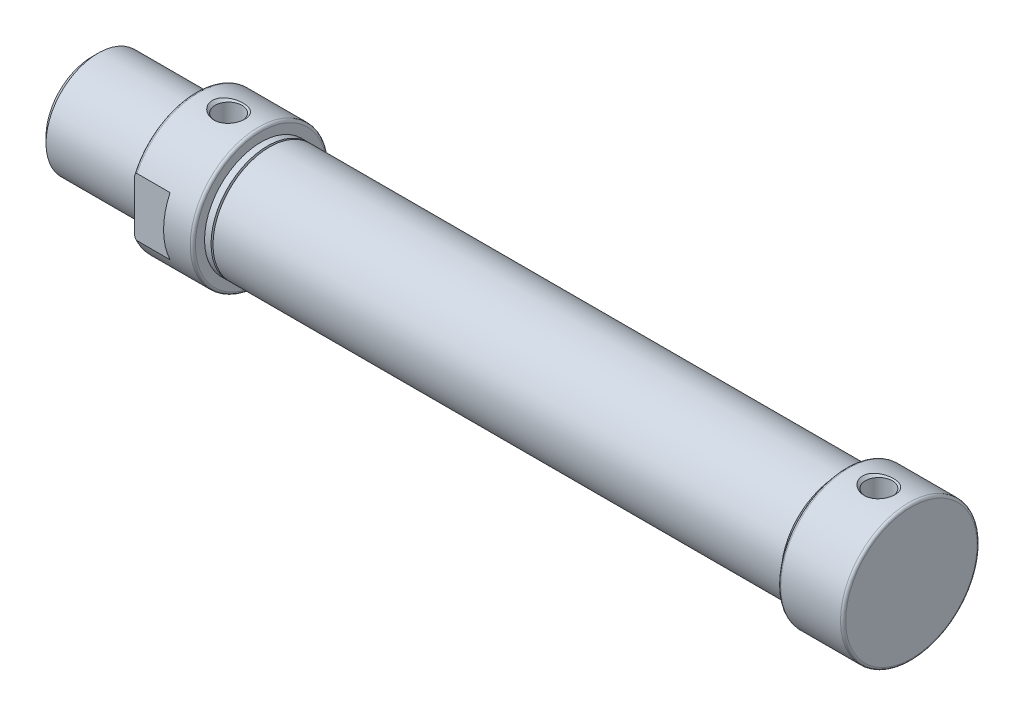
ISO-10303-21;
HEADER;
FILE_DESCRIPTION(('STEP AP214'),'2;1');
FILE_NAME('part.step','',(''),(''),'','','');
FILE_SCHEMA(('AUTOMOTIVE_DESIGN { 1 0 10303 214 1 1 1 1 }'));
ENDSEC;
DATA;
#1=APPLICATION_CONTEXT('core data for automotive mechanical design processes');
#2=APPLICATION_PROTOCOL_DEFINITION('international standard','automotive_design',2000,#1);
#3=PRODUCT_CONTEXT('',#1,'mechanical');
#4=PRODUCT('Part','Part','',(#3));
#5=PRODUCT_RELATED_PRODUCT_CATEGORY('part','',(#4));
#6=PRODUCT_DEFINITION_FORMATION('','',#4);
#7=PRODUCT_DEFINITION_CONTEXT('part definition',#1,'design');
#8=PRODUCT_DEFINITION('design','',#6,#7);
#9=PRODUCT_DEFINITION_SHAPE('','',#8);
#10=(LENGTH_UNIT() NAMED_UNIT(*) SI_UNIT(.MILLI.,.METRE.));
#11=(NAMED_UNIT(*) PLANE_ANGLE_UNIT() SI_UNIT($,.RADIAN.));
#12=(NAMED_UNIT(*) SI_UNIT($,.STERADIAN.) SOLID_ANGLE_UNIT());
#13=UNCERTAINTY_MEASURE_WITH_UNIT(LENGTH_MEASURE(1.E-05),#10,'distance_accuracy_value','');
#14=(GEOMETRIC_REPRESENTATION_CONTEXT(3) GLOBAL_UNCERTAINTY_ASSIGNED_CONTEXT((#13)) GLOBAL_UNIT_ASSIGNED_CONTEXT((#10,
#11,#12)) REPRESENTATION_CONTEXT('',''));
#15=CARTESIAN_POINT('',(0.,0.,0.));
#16=DIRECTION('',(0.,0.,1.));
#17=DIRECTION('',(1.,0.,0.));
#18=AXIS2_PLACEMENT_3D('',#15,#16,#17);
#19=CARTESIAN_POINT('',(126.,0.,0.));
#20=DIRECTION('',(-1.,0.,0.));
#21=DIRECTION('',(0.,0.,1.));
#22=AXIS2_PLACEMENT_3D('',#19,#20,#21);
#23=CYLINDRICAL_SURFACE('',#22,10.5);
#24=CARTESIAN_POINT('',(125.6,0.,0.));
#25=DIRECTION('',(-1.,0.,0.));
#26=DIRECTION('',(0.,0.,1.));
#27=AXIS2_PLACEMENT_3D('',#24,#25,#26);
#28=CIRCLE('',#27,10.5);
#29=CARTESIAN_POINT('',(125.6,0.,10.5));
#30=VERTEX_POINT('',#29);
#31=EDGE_CURVE('E184',#30,#30,#28,.T.);
#32=ORIENTED_EDGE('',*,*,#31,.T.);
#33=EDGE_LOOP('',(#32));
#34=FACE_BOUND('',#33,.T.);
#35=CARTESIAN_POINT('',(116.4,0.,0.));
#36=DIRECTION('',(-1.,0.,0.));
#37=DIRECTION('',(0.,0.,1.));
#38=AXIS2_PLACEMENT_3D('',#35,#36,#37);
#39=CIRCLE('',#38,10.5);
#40=CARTESIAN_POINT('',(116.4,0.,10.5));
#41=VERTEX_POINT('',#40);
#42=EDGE_CURVE('E187',#41,#41,#39,.T.);
#43=ORIENTED_EDGE('',*,*,#42,.F.);
#44=EDGE_LOOP('',(#43));
#45=FACE_BOUND('',#44,.T.);
#46=CARTESIAN_POINT('',(119.309460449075,10.3681992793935,-1.65844620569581));
#47=CARTESIAN_POINT('',(119.219654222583,10.3801184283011,-1.58392560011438));
#48=CARTESIAN_POINT('',(119.135225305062,10.3922449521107,-1.50297447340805));
#49=CARTESIAN_POINT('',(118.9793399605,10.4158892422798,-1.32925986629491));
#50=CARTESIAN_POINT('',(118.907885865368,10.4274068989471,-1.2364942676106));
#51=CARTESIAN_POINT('',(118.771957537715,10.4501643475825,-1.02783283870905));
#52=CARTESIAN_POINT('',(118.709623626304,10.4611701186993,-0.910498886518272));
#53=CARTESIAN_POINT('',(118.607892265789,10.4795728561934,-0.665979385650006));
#54=CARTESIAN_POINT('',(118.568484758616,10.4869714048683,-0.538798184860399));
#55=CARTESIAN_POINT('',(118.517751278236,10.496577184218,-0.292383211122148));
#56=CARTESIAN_POINT('',(118.503959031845,10.499239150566,-0.173672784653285));
#57=CARTESIAN_POINT('',(118.497521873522,10.5004760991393,0.0643135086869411));
#58=CARTESIAN_POINT('',(118.504867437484,10.4990529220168,0.18358909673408));
#59=CARTESIAN_POINT('',(118.539209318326,10.4925053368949,0.41183296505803));
#60=CARTESIAN_POINT('',(118.56500706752,10.4876068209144,0.520991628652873));
#61=CARTESIAN_POINT('',(118.633705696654,10.4748844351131,0.733584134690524));
#62=CARTESIAN_POINT('',(118.676608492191,10.4670602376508,0.837017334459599));
#63=CARTESIAN_POINT('',(118.779538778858,10.448949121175,1.03929967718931));
#64=CARTESIAN_POINT('',(118.840110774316,10.4385859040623,1.13786359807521));
#65=CARTESIAN_POINT('',(118.975489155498,10.4165532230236,1.32448731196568));
#66=CARTESIAN_POINT('',(119.050300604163,10.4048832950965,1.41254335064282));
#67=CARTESIAN_POINT('',(119.219809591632,10.3801083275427,1.58482061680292));
#68=CARTESIAN_POINT('',(119.315735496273,10.3669744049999,1.66782829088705));
#69=CARTESIAN_POINT('',(119.519174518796,10.3416406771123,1.81832451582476));
#70=CARTESIAN_POINT('',(119.626692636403,10.3294412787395,1.88580633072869));
#71=CARTESIAN_POINT('',(119.8619720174,10.305959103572,2.01038307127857));
#72=CARTESIAN_POINT('',(119.990680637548,10.2948942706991,2.06573401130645));
#73=CARTESIAN_POINT('',(120.255393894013,10.2764273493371,2.15572625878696));
#74=CARTESIAN_POINT('',(120.391400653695,10.2690263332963,2.19036150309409));
#75=CARTESIAN_POINT('',(120.675528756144,10.2583548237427,2.23983343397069));
#76=CARTESIAN_POINT('',(120.823888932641,10.2553568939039,2.25336664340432));
#77=CARTESIAN_POINT('',(121.120871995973,10.2547000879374,2.25635204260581));
#78=CARTESIAN_POINT('',(121.269494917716,10.2570419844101,2.24580074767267));
#79=CARTESIAN_POINT('',(121.565340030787,10.2668740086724,2.20041926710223));
#80=CARTESIAN_POINT('',(121.712498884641,10.2744482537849,2.16519225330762));
#81=CARTESIAN_POINT('',(121.998597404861,10.2939217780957,2.07062575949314));
#82=CARTESIAN_POINT('',(122.137536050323,10.3058215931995,2.01128329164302));
#83=CARTESIAN_POINT('',(122.401127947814,10.3323114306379,1.87040017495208));
#84=CARTESIAN_POINT('',(122.525940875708,10.3468651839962,1.78915247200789));
#85=CARTESIAN_POINT('',(122.75890099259,10.3769350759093,1.60556442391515));
#86=CARTESIAN_POINT('',(122.86705225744,10.3924509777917,1.50322925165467));
#87=CARTESIAN_POINT('',(123.056038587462,10.421420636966,1.28653750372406));
#88=CARTESIAN_POINT('',(123.138139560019,10.4349424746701,1.17329858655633));
#89=CARTESIAN_POINT('',(123.279477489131,10.4591519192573,0.933077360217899));
#90=CARTESIAN_POINT('',(123.338737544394,10.4698423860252,0.806109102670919));
#91=CARTESIAN_POINT('',(123.425737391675,10.4858551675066,0.557325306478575));
#92=CARTESIAN_POINT('',(123.456251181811,10.4916425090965,0.43650897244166));
#93=CARTESIAN_POINT('',(123.494727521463,10.4989731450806,0.191228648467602));
#94=CARTESIAN_POINT('',(123.502704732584,10.5005191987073,0.0667670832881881));
#95=CARTESIAN_POINT('',(123.495979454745,10.4992277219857,-0.170417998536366));
#96=CARTESIAN_POINT('',(123.483224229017,10.496766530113,-0.283204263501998));
#97=CARTESIAN_POINT('',(123.439278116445,10.4884371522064,-0.50497491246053));
#98=CARTESIAN_POINT('',(123.408087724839,10.4825690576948,-0.613959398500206));
#99=CARTESIAN_POINT('',(123.328633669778,10.4680396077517,-0.825483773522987));
#100=CARTESIAN_POINT('',(123.280340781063,10.4593734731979,-0.928012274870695));
#101=CARTESIAN_POINT('',(123.16861442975,10.4401071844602,-1.12423241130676));
#102=CARTESIAN_POINT('',(123.105176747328,10.4295064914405,-1.21792157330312));
#103=CARTESIAN_POINT('',(122.959536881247,10.406417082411,-1.40206763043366));
#104=CARTESIAN_POINT('',(122.87622492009,10.3938448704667,-1.49163473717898));
#105=CARTESIAN_POINT('',(122.696986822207,10.3687536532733,-1.65709557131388));
#106=CARTESIAN_POINT('',(122.601055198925,10.3562346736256,-1.73298331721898));
#107=CARTESIAN_POINT('',(122.388304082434,10.3310850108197,-1.87739926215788));
#108=CARTESIAN_POINT('',(122.270348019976,10.3185849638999,-1.94427796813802));
#109=CARTESIAN_POINT('',(122.025317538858,10.2962888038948,-2.05909305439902));
#110=CARTESIAN_POINT('',(121.898239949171,10.2864936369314,-2.10702280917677));
#111=CARTESIAN_POINT('',(121.62806319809,10.2699689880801,-2.18621099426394));
#112=CARTESIAN_POINT('',(121.48448398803,10.2635338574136,-2.21590041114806));
#113=CARTESIAN_POINT('',(121.194284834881,10.2556659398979,-2.25203420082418));
#114=CARTESIAN_POINT('',(121.047664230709,10.2542342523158,-2.2584734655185));
#115=CARTESIAN_POINT('',(120.750960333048,10.2565717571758,-2.24783735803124));
#116=CARTESIAN_POINT('',(120.6009028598,10.260496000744,-2.230060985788));
#117=CARTESIAN_POINT('',(120.305964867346,10.2733569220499,-2.17003948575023));
#118=CARTESIAN_POINT('',(120.161084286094,10.2822935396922,-2.12779465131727));
#119=CARTESIAN_POINT('',(119.89205577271,10.3032168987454,-2.02392589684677));
#120=CARTESIAN_POINT('',(119.767176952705,10.314901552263,-1.96412782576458));
#121=CARTESIAN_POINT('',(119.528863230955,10.3403621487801,-1.82534198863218));
#122=CARTESIAN_POINT('',(119.415419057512,10.3541363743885,-1.74636994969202));
#123=CARTESIAN_POINT('',(119.309460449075,10.3681992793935,-1.65844620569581));
#124=B_SPLINE_CURVE_WITH_KNOTS('',3,(#46,#47,#48,#49,#50,#51,#52,#53,#54,#55,#56,#57,#58,#59,
#60,#61,#62,#63,#64,#65,#66,#67,#68,#69,#70,#71,#72,#73,#74,#75,#76,#77,#78,#79,#80,#81,#82,#83,
#84,#85,#86,#87,#88,#89,#90,#91,#92,#93,#94,#95,#96,#97,#98,#99,#100,#101,#102,#103,#104,#105,
#106,#107,#108,#109,#110,#111,#112,#113,#114,#115,#116,#117,#118,#119,#120,#121,#122,#123),
.UNSPECIFIED.,.T.,.F.,(4,2,2,2,2,2,2,2,2,2,2,2,2,2,2,2,2,2,2,2,2,2,2,2,2,2,2,2,2,2,2,2,2,2,2,2,
2,2,4),(0.,0.351562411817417,0.703187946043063,1.10087280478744,1.49838306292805,
1.85510993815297,2.21167610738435,2.54696852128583,2.88229849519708,3.22931033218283,
3.57644578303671,3.95746949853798,4.33865821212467,4.75845050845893,5.17836561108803,
5.62331560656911,6.06832998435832,6.52067034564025,6.97306676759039,7.41968994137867,
7.86620368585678,8.28541519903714,8.7042016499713,9.07637972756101,9.44831562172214,
9.78728990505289,10.1262550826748,10.4658023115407,10.805444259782,11.1728413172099,
11.5403986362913,11.9471783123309,12.3541000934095,12.7923742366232,13.2307446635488,
13.6820784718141,14.1334068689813,14.5485400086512,14.9633337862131),.UNSPECIFIED.);
#125=CARTESIAN_POINT('',(119.309460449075,10.3681992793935,-1.65844620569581));
#126=VERTEX_POINT('',#125);
#127=EDGE_CURVE('E11',#126,#126,#124,.T.);
#128=ORIENTED_EDGE('',*,*,#127,.F.);
#129=EDGE_LOOP('',(#128));
#130=FACE_BOUND('',#129,.T.);
#131=ADVANCED_FACE('F16',(#34,#45,#130),#23,.T.);
#132=CARTESIAN_POINT('',(126.,0.,0.));
#133=DIRECTION('',(-1.,0.,0.));
#134=DIRECTION('',(0.,0.,1.));
#135=AXIS2_PLACEMENT_3D('',#132,#133,#134);
#136=CYLINDRICAL_SURFACE('',#135,10.5);
#137=CARTESIAN_POINT('',(25.6,0.,0.));
#138=DIRECTION('',(-1.,0.,0.));
#139=DIRECTION('',(0.,0.,1.));
#140=AXIS2_PLACEMENT_3D('',#137,#138,#139);
#141=CIRCLE('',#140,10.5);
#142=CARTESIAN_POINT('',(25.6,0.,10.5));
#143=VERTEX_POINT('',#142);
#144=EDGE_CURVE('E219',#143,#143,#141,.T.);
#145=ORIENTED_EDGE('',*,*,#144,.T.);
#146=EDGE_LOOP('',(#145));
#147=FACE_BOUND('',#146,.T.);
#148=DIRECTION('',(-1.,0.,0.));
#149=VECTOR('',#148,1.);
#150=CARTESIAN_POINT('',(126.,-4.47213595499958,9.5));
#151=LINE('',#150,#149);
#152=CARTESIAN_POINT('',(21.5,-4.47213595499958,9.5));
#153=VERTEX_POINT('',#152);
#154=CARTESIAN_POINT('',(16.4,-4.47213595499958,9.5));
#155=VERTEX_POINT('',#154);
#156=EDGE_CURVE('E125',#153,#155,#151,.T.);
#157=ORIENTED_EDGE('',*,*,#156,.T.);
#158=CARTESIAN_POINT('',(16.4,0.,0.));
#159=DIRECTION('',(-1.,0.,0.));
#160=DIRECTION('',(0.,0.,1.));
#161=AXIS2_PLACEMENT_3D('',#158,#159,#160);
#162=CIRCLE('',#161,10.5);
#163=CARTESIAN_POINT('',(16.4,-4.47213595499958,-9.5));
#164=VERTEX_POINT('',#163);
#165=EDGE_CURVE('E102',#164,#155,#162,.T.);
#166=ORIENTED_EDGE('',*,*,#165,.F.);
#167=DIRECTION('',(-1.,0.,0.));
#168=VECTOR('',#167,1.);
#169=CARTESIAN_POINT('',(126.,-4.47213595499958,-9.5));
#170=LINE('',#169,#168);
#171=CARTESIAN_POINT('',(21.5,-4.47213595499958,-9.5));
#172=VERTEX_POINT('',#171);
#173=EDGE_CURVE('E79',#164,#172,#170,.F.);
#174=ORIENTED_EDGE('',*,*,#173,.T.);
#175=CARTESIAN_POINT('',(21.5,0.,0.));
#176=DIRECTION('',(1.,0.,0.));
#177=DIRECTION('',(0.,0.,-1.));
#178=AXIS2_PLACEMENT_3D('',#175,#176,#177);
#179=CIRCLE('',#178,10.5);
#180=CARTESIAN_POINT('',(21.5,4.47213595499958,-9.5));
#181=VERTEX_POINT('',#180);
#182=EDGE_CURVE('E115',#172,#181,#179,.T.);
#183=ORIENTED_EDGE('',*,*,#182,.T.);
#184=DIRECTION('',(-1.,0.,0.));
#185=VECTOR('',#184,1.);
#186=CARTESIAN_POINT('',(126.,4.47213595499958,-9.5));
#187=LINE('',#186,#185);
#188=CARTESIAN_POINT('',(16.4,4.47213595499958,-9.5));
#189=VERTEX_POINT('',#188);
#190=EDGE_CURVE('E118',#181,#189,#187,.T.);
#191=ORIENTED_EDGE('',*,*,#190,.T.);
#192=CARTESIAN_POINT('',(16.4,4.47213595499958,9.5));
#193=VERTEX_POINT('',#192);
#194=EDGE_CURVE('E99',#193,#189,#162,.T.);
#195=ORIENTED_EDGE('',*,*,#194,.F.);
#196=DIRECTION('',(-1.,0.,0.));
#197=VECTOR('',#196,1.);
#198=CARTESIAN_POINT('',(126.,4.47213595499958,9.5));
#199=LINE('',#198,#197);
#200=CARTESIAN_POINT('',(21.5,4.47213595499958,9.5));
#201=VERTEX_POINT('',#200);
#202=EDGE_CURVE('E122',#193,#201,#199,.F.);
#203=ORIENTED_EDGE('',*,*,#202,.T.);
#204=EDGE_CURVE('E119',#201,#153,#179,.T.);
#205=ORIENTED_EDGE('',*,*,#204,.T.);
#206=EDGE_LOOP('',(#157,#166,#174,#183,#191,#195,#203,#205));
#207=FACE_BOUND('',#206,.T.);
#208=CARTESIAN_POINT('',(19.3094604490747,10.3681992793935,-1.65844620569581));
#209=CARTESIAN_POINT('',(19.2196542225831,10.3801184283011,-1.58392560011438));
#210=CARTESIAN_POINT('',(19.1352253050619,10.3922449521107,-1.50297447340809));
#211=CARTESIAN_POINT('',(18.9793399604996,10.4158892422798,-1.32925986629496));
#212=CARTESIAN_POINT('',(18.907885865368,10.4274068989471,-1.23649426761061));
#213=CARTESIAN_POINT('',(18.7719575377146,10.4501643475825,-1.02783283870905));
#214=CARTESIAN_POINT('',(18.7096236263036,10.4611701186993,-0.910498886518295));
#215=CARTESIAN_POINT('',(18.6078922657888,10.4795728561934,-0.665979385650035));
#216=CARTESIAN_POINT('',(18.5684847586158,10.4869714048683,-0.538798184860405));
#217=CARTESIAN_POINT('',(18.5177512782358,10.496577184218,-0.292383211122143));
#218=CARTESIAN_POINT('',(18.5039590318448,10.499239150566,-0.173672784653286));
#219=CARTESIAN_POINT('',(18.4975218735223,10.5004760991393,0.0643135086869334));
#220=CARTESIAN_POINT('',(18.504867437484,10.4990529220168,0.183589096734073));
#221=CARTESIAN_POINT('',(18.5392093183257,10.4925053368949,0.411832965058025));
#222=CARTESIAN_POINT('',(18.5650070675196,10.4876068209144,0.52099162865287));
#223=CARTESIAN_POINT('',(18.6337056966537,10.4748844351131,0.733584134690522));
#224=CARTESIAN_POINT('',(18.6766084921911,10.4670602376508,0.837017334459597));
#225=CARTESIAN_POINT('',(18.7795387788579,10.448949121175,1.0392996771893));
#226=CARTESIAN_POINT('',(18.8401107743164,10.4385859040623,1.1378635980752));
#227=CARTESIAN_POINT('',(18.975489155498,10.4165532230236,1.32448731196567));
#228=CARTESIAN_POINT('',(19.0503006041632,10.4048832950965,1.41254335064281));
#229=CARTESIAN_POINT('',(19.2198095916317,10.3801083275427,1.58482061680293));
#230=CARTESIAN_POINT('',(19.315735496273,10.3669744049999,1.66782829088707));
#231=CARTESIAN_POINT('',(19.5191745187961,10.3416406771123,1.81832451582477));
#232=CARTESIAN_POINT('',(19.6266926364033,10.3294412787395,1.88580633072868));
#233=CARTESIAN_POINT('',(19.8619720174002,10.305959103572,2.01038307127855));
#234=CARTESIAN_POINT('',(19.9906806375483,10.2948942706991,2.06573401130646));
#235=CARTESIAN_POINT('',(20.2553938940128,10.2764273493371,2.15572625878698));
#236=CARTESIAN_POINT('',(20.3914006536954,10.2690263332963,2.1903615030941));
#237=CARTESIAN_POINT('',(20.6755287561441,10.2583548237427,2.23983343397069));
#238=CARTESIAN_POINT('',(20.8238889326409,10.2553568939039,2.25336664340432));
#239=CARTESIAN_POINT('',(21.1208719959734,10.2547000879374,2.25635204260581));
#240=CARTESIAN_POINT('',(21.2694949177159,10.2570419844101,2.24580074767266));
#241=CARTESIAN_POINT('',(21.5653400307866,10.2668740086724,2.20041926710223));
#242=CARTESIAN_POINT('',(21.7124988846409,10.2744482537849,2.16519225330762));
#243=CARTESIAN_POINT('',(21.9985974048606,10.2939217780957,2.07062575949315));
#244=CARTESIAN_POINT('',(22.137536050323,10.3058215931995,2.01128329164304));
#245=CARTESIAN_POINT('',(22.4011279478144,10.3323114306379,1.87040017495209));
#246=CARTESIAN_POINT('',(22.5259408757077,10.3468651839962,1.78915247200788));
#247=CARTESIAN_POINT('',(22.7589009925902,10.3769350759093,1.60556442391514));
#248=CARTESIAN_POINT('',(22.8670522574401,10.3924509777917,1.50322925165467));
#249=CARTESIAN_POINT('',(23.0560385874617,10.421420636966,1.28653750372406));
#250=CARTESIAN_POINT('',(23.1381395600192,10.4349424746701,1.17329858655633));
#251=CARTESIAN_POINT('',(23.2794774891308,10.4591519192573,0.9330773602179));
#252=CARTESIAN_POINT('',(23.3387375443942,10.4698423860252,0.806109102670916));
#253=CARTESIAN_POINT('',(23.4257373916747,10.4858551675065,0.557325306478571));
#254=CARTESIAN_POINT('',(23.456251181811,10.4916425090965,0.436508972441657));
#255=CARTESIAN_POINT('',(23.494727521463,10.4989731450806,0.191228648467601));
#256=CARTESIAN_POINT('',(23.5027047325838,10.5005191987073,0.0667670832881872));
#257=CARTESIAN_POINT('',(23.4959794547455,10.4992277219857,-0.170417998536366));
#258=CARTESIAN_POINT('',(23.4832242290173,10.496766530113,-0.283204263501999));
#259=CARTESIAN_POINT('',(23.4392781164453,10.4884371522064,-0.504974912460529));
#260=CARTESIAN_POINT('',(23.4080877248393,10.4825690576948,-0.613959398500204));
#261=CARTESIAN_POINT('',(23.3286336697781,10.4680396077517,-0.825483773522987));
#262=CARTESIAN_POINT('',(23.2803407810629,10.4593734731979,-0.928012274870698));
#263=CARTESIAN_POINT('',(23.16861442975,10.4401071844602,-1.12423241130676));
#264=CARTESIAN_POINT('',(23.1051767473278,10.4295064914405,-1.21792157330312));
#265=CARTESIAN_POINT('',(22.9595368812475,10.406417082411,-1.40206763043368));
#266=CARTESIAN_POINT('',(22.8762249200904,10.3938448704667,-1.49163473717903));
#267=CARTESIAN_POINT('',(22.6969868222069,10.3687536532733,-1.65709557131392));
#268=CARTESIAN_POINT('',(22.6010551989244,10.3562346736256,-1.73298331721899));
#269=CARTESIAN_POINT('',(22.3883040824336,10.3310850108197,-1.87739926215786));
#270=CARTESIAN_POINT('',(22.2703480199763,10.3185849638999,-1.94427796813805));
#271=CARTESIAN_POINT('',(22.0253175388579,10.2962888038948,-2.05909305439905));
#272=CARTESIAN_POINT('',(21.8982399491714,10.2864936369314,-2.10702280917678));
#273=CARTESIAN_POINT('',(21.6280631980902,10.2699689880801,-2.18621099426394));
#274=CARTESIAN_POINT('',(21.4844839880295,10.2635338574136,-2.21590041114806));
#275=CARTESIAN_POINT('',(21.1942848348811,10.2556659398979,-2.25203420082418));
#276=CARTESIAN_POINT('',(21.0476642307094,10.2542342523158,-2.25847346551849));
#277=CARTESIAN_POINT('',(20.7509603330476,10.2565717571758,-2.24783735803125));
#278=CARTESIAN_POINT('',(20.6009028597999,10.260496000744,-2.23006098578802));
#279=CARTESIAN_POINT('',(20.3059648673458,10.2733569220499,-2.17003948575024));
#280=CARTESIAN_POINT('',(20.1610842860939,10.2822935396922,-2.12779465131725));
#281=CARTESIAN_POINT('',(19.8920557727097,10.3032168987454,-2.02392589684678));
#282=CARTESIAN_POINT('',(19.7671769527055,10.314901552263,-1.96412782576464));
#283=CARTESIAN_POINT('',(19.5288632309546,10.3403621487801,-1.82534198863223));
#284=CARTESIAN_POINT('',(19.4154190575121,10.3541363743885,-1.74636994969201));
#285=CARTESIAN_POINT('',(19.3094604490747,10.3681992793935,-1.65844620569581));
#286=B_SPLINE_CURVE_WITH_KNOTS('',3,(#208,#209,#210,#211,#212,#213,#214,#215,#216,#217,#218,
#219,#220,#221,#222,#223,#224,#225,#226,#227,#228,#229,#230,#231,#232,#233,#234,#235,#236,#237,
#238,#239,#240,#241,#242,#243,#244,#245,#246,#247,#248,#249,#250,#251,#252,#253,#254,#255,#256,
#257,#258,#259,#260,#261,#262,#263,#264,#265,#266,#267,#268,#269,#270,#271,#272,#273,#274,#275,
#276,#277,#278,#279,#280,#281,#282,#283,#284,#285),.UNSPECIFIED.,.T.,.F.,(4,2,2,2,2,2,2,2,2,2,2,
2,2,2,2,2,2,2,2,2,2,2,2,2,2,2,2,2,2,2,2,2,2,2,2,2,2,2,4),(0.,0.351562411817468,
0.703187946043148,1.10087280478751,1.49838306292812,1.85510993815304,2.21167610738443,
2.5469685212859,2.88229849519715,3.22931033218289,3.57644578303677,3.95746949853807,
4.33865821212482,4.75845050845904,5.17836561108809,5.62331560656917,6.06832998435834,
6.5206703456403,6.97306676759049,7.41968994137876,7.86620368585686,8.28541519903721,
8.70420164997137,9.07637972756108,9.44831562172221,9.78728990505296,10.1262550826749,
10.4658023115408,10.8054442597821,11.17284131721,11.5403986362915,11.9471783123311,
12.3541000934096,12.7923742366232,13.2307446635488,13.6820784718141,14.1334068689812,
14.5485400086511,14.9633337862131),.UNSPECIFIED.);
#287=CARTESIAN_POINT('',(19.3094604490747,10.3681992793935,-1.65844620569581));
#288=VERTEX_POINT('',#287);
#289=EDGE_CURVE('E29',#288,#288,#286,.T.);
#290=ORIENTED_EDGE('',*,*,#289,.F.);
#291=EDGE_LOOP('',(#290));
#292=FACE_BOUND('',#291,.T.);
#293=ADVANCED_FACE('F133',(#147,#207,#292),#136,.T.);
#294=CARTESIAN_POINT('',(16.4,0.,0.));
#295=DIRECTION('',(-1.,0.,0.));
#296=DIRECTION('',(0.,0.,1.));
#297=AXIS2_PLACEMENT_3D('',#294,#295,#296);
#298=TOROIDAL_SURFACE('',#297,10.1,0.4);
#299=ORIENTED_EDGE('',*,*,#165,.T.);
#300=CARTESIAN_POINT('',(16.4021928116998,-4.47212184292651,9.5));
#301=CARTESIAN_POINT('',(16.3918519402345,-4.47225336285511,9.5));
#302=CARTESIAN_POINT('',(16.3814872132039,-4.47143578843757,9.5));
#303=CARTESIAN_POINT('',(16.3610600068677,-4.46798509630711,9.5));
#304=CARTESIAN_POINT('',(16.3509981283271,-4.46534859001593,9.5));
#305=CARTESIAN_POINT('',(16.3292591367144,-4.45775040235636,9.5));
#306=CARTESIAN_POINT('',(16.3177181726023,-4.45240293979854,9.5));
#307=CARTESIAN_POINT('',(16.2956553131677,-4.43992098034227,9.5));
#308=CARTESIAN_POINT('',(16.2851352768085,-4.43278330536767,9.5));
#309=CARTESIAN_POINT('',(16.2593117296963,-4.41268921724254,9.5));
#310=CARTESIAN_POINT('',(16.244773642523,-4.39875934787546,9.5));
#311=CARTESIAN_POINT('',(16.2178971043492,-4.36893563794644,9.5));
#312=CARTESIAN_POINT('',(16.2055645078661,-4.35303675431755,9.5));
#313=CARTESIAN_POINT('',(16.1828688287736,-4.32022741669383,9.5));
#314=CARTESIAN_POINT('',(16.1724813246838,-4.3033335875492,9.5));
#315=CARTESIAN_POINT('',(16.1531563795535,-4.26872833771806,9.5));
#316=CARTESIAN_POINT('',(16.1442203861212,-4.25101612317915,9.5));
#317=CARTESIAN_POINT('',(16.1192017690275,-4.19699001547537,9.5));
#318=CARTESIAN_POINT('',(16.1049407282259,-4.15983722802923,9.5));
#319=CARTESIAN_POINT('',(16.0746568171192,-4.06835744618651,9.5));
#320=CARTESIAN_POINT('',(16.0604661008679,-4.01344913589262,9.5));
#321=CARTESIAN_POINT('',(16.0372054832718,-3.90250621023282,9.5));
#322=CARTESIAN_POINT('',(16.0281458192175,-3.84646957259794,9.5));
#323=CARTESIAN_POINT('',(16.0140110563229,-3.73369807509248,9.5));
#324=CARTESIAN_POINT('',(16.0089512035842,-3.67696137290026,9.5));
#325=CARTESIAN_POINT('',(16.0021415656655,-3.56328407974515,9.5));
#326=CARTESIAN_POINT('',(16.0003929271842,-3.50634342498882,9.5));
#327=CARTESIAN_POINT('',(15.9995720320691,-3.36652251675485,9.5));
#328=CARTESIAN_POINT('',(16.0020804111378,-3.28363316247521,9.5));
#329=CARTESIAN_POINT('',(16.0122035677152,-3.11811965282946,9.5));
#330=CARTESIAN_POINT('',(16.0198223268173,-3.03549575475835,9.5));
#331=CARTESIAN_POINT('',(16.0398120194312,-2.87105530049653,9.5));
#332=CARTESIAN_POINT('',(16.0521701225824,-2.78923717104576,9.5));
#333=CARTESIAN_POINT('',(16.0818253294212,-2.62653841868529,9.5));
#334=CARTESIAN_POINT('',(16.0991182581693,-2.5456570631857,9.5));
#335=CARTESIAN_POINT('',(16.1313160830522,-2.41975731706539,9.5));
#336=CARTESIAN_POINT('',(16.1440813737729,-2.37418934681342,9.5));
#337=CARTESIAN_POINT('',(16.1723590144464,-2.28399216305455,9.5));
#338=CARTESIAN_POINT('',(16.187864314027,-2.2393608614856,9.5));
#339=CARTESIAN_POINT('',(16.2125868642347,-2.1783486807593,9.5));
#340=CARTESIAN_POINT('',(16.2199329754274,-2.1612126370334,9.5));
#341=CARTESIAN_POINT('',(16.2355759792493,-2.12730143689,9.5));
#342=CARTESIAN_POINT('',(16.2438758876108,-2.1105276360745,9.5));
#343=CARTESIAN_POINT('',(16.2620100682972,-2.07718719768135,9.5));
#344=CARTESIAN_POINT('',(16.27188237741,-2.06064126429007,9.5));
#345=CARTESIAN_POINT('',(16.2936246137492,-2.02893226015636,9.5));
#346=CARTESIAN_POINT('',(16.3054814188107,-2.01376105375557,9.5));
#347=CARTESIAN_POINT('',(16.3234726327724,-1.99572605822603,9.5));
#348=CARTESIAN_POINT('',(16.3281325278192,-1.99141561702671,9.5));
#349=CARTESIAN_POINT('',(16.3378995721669,-1.98331038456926,9.5));
#350=CARTESIAN_POINT('',(16.3430072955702,-1.97951627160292,9.5));
#351=CARTESIAN_POINT('',(16.353786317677,-1.97262601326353,9.5));
#352=CARTESIAN_POINT('',(16.3594644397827,-1.96954025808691,9.5));
#353=CARTESIAN_POINT('',(16.3712933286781,-1.96447725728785,9.5));
#354=CARTESIAN_POINT('',(16.3774422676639,-1.96249594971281,9.5));
#355=CARTESIAN_POINT('',(16.388298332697,-1.96030976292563,9.5));
#356=CARTESIAN_POINT('',(16.3929371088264,-1.95976626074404,9.5));
#357=CARTESIAN_POINT('',(16.4022394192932,-1.95948930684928,9.5));
#358=CARTESIAN_POINT('',(16.4069029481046,-1.95975568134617,9.5));
#359=CARTESIAN_POINT('',(16.4161002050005,-1.96106496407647,9.5));
#360=CARTESIAN_POINT('',(16.4206343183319,-1.96210524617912,9.5));
#361=CARTESIAN_POINT('',(16.4294939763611,-1.96485272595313,9.5));
#362=CARTESIAN_POINT('',(16.4338193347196,-1.96656050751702,9.5));
#363=CARTESIAN_POINT('',(16.4448131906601,-1.9717325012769,9.5));
#364=CARTESIAN_POINT('',(16.4512762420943,-1.97562976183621,9.5));
#365=CARTESIAN_POINT('',(16.4635440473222,-1.98434964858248,9.5));
#366=CARTESIAN_POINT('',(16.469346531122,-1.989175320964,9.5));
#367=CARTESIAN_POINT('',(16.4886306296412,-2.00703491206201,9.5));
#368=CARTESIAN_POINT('',(16.5006744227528,-2.02158716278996,9.5));
#369=CARTESIAN_POINT('',(16.5226956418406,-2.05216976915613,9.5));
#370=CARTESIAN_POINT('',(16.5326593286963,-2.06820900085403,9.5));
#371=CARTESIAN_POINT('',(16.5586035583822,-2.11410805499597,9.5));
#372=CARTESIAN_POINT('',(16.5730708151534,-2.14481878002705,9.5));
#373=CARTESIAN_POINT('',(16.5995426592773,-2.20730144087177,9.5));
#374=CARTESIAN_POINT('',(16.6115404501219,-2.23907603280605,9.5));
#375=CARTESIAN_POINT('',(16.6338431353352,-2.30334709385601,9.5));
#376=CARTESIAN_POINT('',(16.6441416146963,-2.33584579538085,9.5));
#377=CARTESIAN_POINT('',(16.6633951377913,-2.40118303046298,9.5));
#378=CARTESIAN_POINT('',(16.6723519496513,-2.43402105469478,9.5));
#379=CARTESIAN_POINT('',(16.6945029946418,-2.52085018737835,9.5));
#380=CARTESIAN_POINT('',(16.7067906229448,-2.57507337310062,9.5));
#381=CARTESIAN_POINT('',(16.7289786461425,-2.68401117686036,9.5));
#382=CARTESIAN_POINT('',(16.7388783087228,-2.73872594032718,9.5));
#383=CARTESIAN_POINT('',(16.7653550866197,-2.90362052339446,9.5));
#384=CARTESIAN_POINT('',(16.7786585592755,-3.01433890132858,9.5));
#385=CARTESIAN_POINT('',(16.7963474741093,-3.23575581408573,9.5));
#386=CARTESIAN_POINT('',(16.8007937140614,-3.34644923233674,9.5));
#387=CARTESIAN_POINT('',(16.7994357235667,-3.51229931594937,9.5));
#388=CARTESIAN_POINT('',(16.7976511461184,-3.56749403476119,9.5));
#389=CARTESIAN_POINT('',(16.7909583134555,-3.67768548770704,9.5));
#390=CARTESIAN_POINT('',(16.7860514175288,-3.73268229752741,9.5));
#391=CARTESIAN_POINT('',(16.7742624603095,-3.82761297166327,9.5));
#392=CARTESIAN_POINT('',(16.7682557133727,-3.86765376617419,9.5));
#393=CARTESIAN_POINT('',(16.7537889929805,-3.94738060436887,9.5));
#394=CARTESIAN_POINT('',(16.7453238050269,-3.98706570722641,9.5));
#395=CARTESIAN_POINT('',(16.7235885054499,-4.07278509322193,9.5));
#396=CARTESIAN_POINT('',(16.709728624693,-4.11868023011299,9.5));
#397=CARTESIAN_POINT('',(16.6846597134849,-4.18584846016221,9.5));
#398=CARTESIAN_POINT('',(16.6756075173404,-4.207925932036,9.5));
#399=CARTESIAN_POINT('',(16.655766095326,-4.25127784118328,9.5));
#400=CARTESIAN_POINT('',(16.6449787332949,-4.27255311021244,9.5));
#401=CARTESIAN_POINT('',(16.6244499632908,-4.30829980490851,9.5));
#402=CARTESIAN_POINT('',(16.6152116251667,-4.32305820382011,9.5));
#403=CARTESIAN_POINT('',(16.595346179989,-4.35166086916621,9.5));
#404=CARTESIAN_POINT('',(16.5847169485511,-4.36550368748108,9.5));
#405=CARTESIAN_POINT('',(16.561695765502,-4.39193908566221,9.5));
#406=CARTESIAN_POINT('',(16.5492853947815,-4.40451591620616,9.5));
#407=CARTESIAN_POINT('',(16.5225328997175,-4.42743280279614,9.5));
#408=CARTESIAN_POINT('',(16.508197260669,-4.43778007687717,9.5));
#409=CARTESIAN_POINT('',(16.4835373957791,-4.45166818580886,9.5));
#410=CARTESIAN_POINT('',(16.473825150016,-4.45629041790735,9.5));
#411=CARTESIAN_POINT('',(16.4537887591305,-4.46390358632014,9.5));
#412=CARTESIAN_POINT('',(16.4434663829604,-4.46689900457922,9.5));
#413=CARTESIAN_POINT('',(16.4278981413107,-4.46992524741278,9.5));
#414=CARTESIAN_POINT('',(16.4227878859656,-4.47068809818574,9.5));
#415=CARTESIAN_POINT('',(16.4125180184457,-4.4717536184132,9.5));
#416=CARTESIAN_POINT('',(16.4073583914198,-4.4720561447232,9.5));
#417=CARTESIAN_POINT('',(16.4021928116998,-4.47212184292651,9.5));
#418=B_SPLINE_CURVE_WITH_KNOTS('',3,(#300,#301,#302,#303,#304,#305,#306,#307,#308,#309,#310,
#311,#312,#313,#314,#315,#316,#317,#318,#319,#320,#321,#322,#323,#324,#325,#326,#327,#328,#329,
#330,#331,#332,#333,#334,#335,#336,#337,#338,#339,#340,#341,#342,#343,#344,#345,#346,#347,#348,
#349,#350,#351,#352,#353,#354,#355,#356,#357,#358,#359,#360,#361,#362,#363,#364,#365,#366,#367,
#368,#369,#370,#371,#372,#373,#374,#375,#376,#377,#378,#379,#380,#381,#382,#383,#384,#385,#386,
#387,#388,#389,#390,#391,#392,#393,#394,#395,#396,#397,#398,#399,#400,#401,#402,#403,#404,#405,
#406,#407,#408,#409,#410,#411,#412,#413,#414,#415,#416,#417),.UNSPECIFIED.,.T.,.F.,(4,2,2,2,2,2,
2,2,2,2,2,2,2,2,2,2,2,2,2,2,2,2,2,2,2,2,2,2,2,2,2,2,2,2,2,2,2,2,2,2,2,2,2,2,2,2,2,2,2,2,2,2,2,2,
2,2,2,2,4),(0.,0.0310034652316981,0.0620648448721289,0.100009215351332,0.138021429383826,
0.198085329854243,0.258306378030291,0.317711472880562,0.377175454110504,0.496281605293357,
0.666065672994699,0.836187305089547,1.00695430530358,1.17778043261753,1.42636727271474,
1.67514801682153,1.92325996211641,2.17116261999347,2.31308492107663,2.45464721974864,
2.51056339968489,2.56666151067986,2.62441430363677,2.68179929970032,2.70081550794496,
2.71985646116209,2.73916102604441,2.75839411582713,2.77233974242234,2.7862823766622,
2.80017791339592,2.81408563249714,2.83659548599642,2.85918049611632,2.91541160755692,
2.97200313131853,3.07358138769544,3.17543557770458,3.27766588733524,3.37976026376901,
3.54648033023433,3.71325145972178,4.04744547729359,4.37933750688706,4.54494143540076,
4.71047331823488,4.83187530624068,4.95353669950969,5.09703877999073,5.16856889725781,
5.24002268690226,5.29219773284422,5.34445341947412,5.39729471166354,5.4499622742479,
5.48211904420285,5.51418676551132,5.52966912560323,5.54515629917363),.UNSPECIFIED.);
#419=CARTESIAN_POINT('',(16.,-3.42928563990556,9.5));
#420=VERTEX_POINT('',#419);
#421=EDGE_CURVE('E98',#155,#420,#418,.T.);
#422=ORIENTED_EDGE('',*,*,#421,.T.);
#423=CARTESIAN_POINT('',(16.,0.,0.));
#424=DIRECTION('',(-1.,0.,0.));
#425=DIRECTION('',(0.,0.,1.));
#426=AXIS2_PLACEMENT_3D('',#423,#424,#425);
#427=CIRCLE('',#426,10.1);
#428=CARTESIAN_POINT('',(16.,-3.42928563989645,-9.5));
#429=VERTEX_POINT('',#428);
#430=EDGE_CURVE('E90',#429,#420,#427,.T.);
#431=ORIENTED_EDGE('',*,*,#430,.F.);
#432=CARTESIAN_POINT('',(16.4021928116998,-4.47212184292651,-9.5));
#433=CARTESIAN_POINT('',(16.4126908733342,-4.47198512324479,-9.5));
#434=CARTESIAN_POINT('',(16.4231856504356,-4.47086999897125,-9.5));
#435=CARTESIAN_POINT('',(16.4438155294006,-4.46680084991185,-9.5));
#436=CARTESIAN_POINT('',(16.4539499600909,-4.46384356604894,-9.5));
#437=CARTESIAN_POINT('',(16.4759754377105,-4.45547185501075,-9.5));
#438=CARTESIAN_POINT('',(16.4877055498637,-4.44963846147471,-9.5));
#439=CARTESIAN_POINT('',(16.5100738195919,-4.436171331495,-9.5));
#440=CARTESIAN_POINT('',(16.5207098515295,-4.4285341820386,-9.5));
#441=CARTESIAN_POINT('',(16.5470646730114,-4.40691945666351,-9.5));
#442=CARTESIAN_POINT('',(16.5619315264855,-4.39191402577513,-9.5));
#443=CARTESIAN_POINT('',(16.5893247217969,-4.35992066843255,-9.5));
#444=CARTESIAN_POINT('',(16.6018448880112,-4.34292769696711,-9.5));
#445=CARTESIAN_POINT('',(16.6250079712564,-4.30766231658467,-9.5));
#446=CARTESIAN_POINT('',(16.6356459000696,-4.28938668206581,-9.5));
#447=CARTESIAN_POINT('',(16.6553608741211,-4.25200393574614,-9.5));
#448=CARTESIAN_POINT('',(16.6644363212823,-4.23289599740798,-9.5));
#449=CARTESIAN_POINT('',(16.6897501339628,-4.1746666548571,-9.5));
#450=CARTESIAN_POINT('',(16.7040381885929,-4.13470235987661,-9.5));
#451=CARTESIAN_POINT('',(16.7342813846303,-4.03587976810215,-9.5));
#452=CARTESIAN_POINT('',(16.7482142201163,-3.9764297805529,-9.5));
#453=CARTESIAN_POINT('',(16.7705506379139,-3.85644361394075,-9.5));
#454=CARTESIAN_POINT('',(16.7789431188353,-3.79590550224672,-9.5));
#455=CARTESIAN_POINT('',(16.7914121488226,-3.67425465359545,-9.5));
#456=CARTESIAN_POINT('',(16.7954779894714,-3.61314086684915,-9.5));
#457=CARTESIAN_POINT('',(16.8000349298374,-3.49076545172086,-9.5));
#458=CARTESIAN_POINT('',(16.800524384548,-3.42950376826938,-9.5));
#459=CARTESIAN_POINT('',(16.7983513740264,-3.30311410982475,-9.5));
#460=CARTESIAN_POINT('',(16.7954848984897,-3.23798996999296,-9.5));
#461=CARTESIAN_POINT('',(16.7866238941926,-3.10797513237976,-9.5));
#462=CARTESIAN_POINT('',(16.7806300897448,-3.04308438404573,-9.5));
#463=CARTESIAN_POINT('',(16.7656886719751,-2.91370156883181,-9.5));
#464=CARTESIAN_POINT('',(16.7567436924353,-2.84920919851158,-9.5));
#465=CARTESIAN_POINT('',(16.7358478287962,-2.72073848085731,-9.5));
#466=CARTESIAN_POINT('',(16.7238980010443,-2.65675996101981,-9.5));
#467=CARTESIAN_POINT('',(16.6957975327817,-2.52550081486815,-9.5));
#468=CARTESIAN_POINT('',(16.6794305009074,-2.45826462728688,-9.5));
#469=CARTESIAN_POINT('',(16.651060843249,-2.35860209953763,-9.5));
#470=CARTESIAN_POINT('',(16.6409850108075,-2.32562650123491,-9.5));
#471=CARTESIAN_POINT('',(16.6191759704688,-2.26023282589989,-9.5));
#472=CARTESIAN_POINT('',(16.6074438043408,-2.22781441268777,-9.5));
#473=CARTESIAN_POINT('',(16.5875154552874,-2.17858398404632,-9.5));
#474=CARTESIAN_POINT('',(16.5801640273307,-2.16143080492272,-9.5));
#475=CARTESIAN_POINT('',(16.5645118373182,-2.12748389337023,-9.5));
#476=CARTESIAN_POINT('',(16.5562080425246,-2.11069152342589,-9.5));
#477=CARTESIAN_POINT('',(16.5380656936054,-2.07731668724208,-9.5));
#478=CARTESIAN_POINT('',(16.5281892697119,-2.06075482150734,-9.5));
#479=CARTESIAN_POINT('',(16.5064373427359,-2.02901341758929,-9.5));
#480=CARTESIAN_POINT('',(16.4945748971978,-2.01382578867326,-9.5));
#481=CARTESIAN_POINT('',(16.4765751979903,-1.99577136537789,-9.5));
#482=CARTESIAN_POINT('',(16.4719141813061,-1.99145713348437,-9.5));
#483=CARTESIAN_POINT('',(16.4621446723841,-1.98334434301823,-9.5));
#484=CARTESIAN_POINT('',(16.4570356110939,-1.9795464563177,-9.5));
#485=CARTESIAN_POINT('',(16.4462534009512,-1.97264863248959,-9.5));
#486=CARTESIAN_POINT('',(16.4405734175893,-1.96955909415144,-9.5));
#487=CARTESIAN_POINT('',(16.4287400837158,-1.96448897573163,-9.5));
#488=CARTESIAN_POINT('',(16.4225885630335,-1.96250433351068,-9.5));
#489=CARTESIAN_POINT('',(16.4117298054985,-1.96031385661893,-9.5));
#490=CARTESIAN_POINT('',(16.4070911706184,-1.95976873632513,-9.5));
#491=CARTESIAN_POINT('',(16.3977888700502,-1.95948852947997,-9.5));
#492=CARTESIAN_POINT('',(16.3931252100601,-1.95975326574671,-9.5));
#493=CARTESIAN_POINT('',(16.3839273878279,-1.96105945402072,-9.5));
#494=CARTESIAN_POINT('',(16.3793928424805,-1.96209828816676,-9.5));
#495=CARTESIAN_POINT('',(16.3705321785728,-1.96484315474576,-9.5));
#496=CARTESIAN_POINT('',(16.36620624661,-1.96654977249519,-9.5));
#497=CARTESIAN_POINT('',(16.3552139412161,-1.97171763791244,-9.5));
#498=CARTESIAN_POINT('',(16.3487526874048,-1.97561152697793,-9.5));
#499=CARTESIAN_POINT('',(16.3364880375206,-1.9843245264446,-9.5));
#500=CARTESIAN_POINT('',(16.330686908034,-1.98914668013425,-9.5));
#501=CARTESIAN_POINT('',(16.311412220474,-2.00698929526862,-9.5));
#502=CARTESIAN_POINT('',(16.2993745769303,-2.02152679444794,-9.5));
#503=CARTESIAN_POINT('',(16.2773640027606,-2.05207948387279,-9.5));
#504=CARTESIAN_POINT('',(16.2674047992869,-2.06810354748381,-9.5));
#505=CARTESIAN_POINT('',(16.2414765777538,-2.11395168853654,-9.5));
#506=CARTESIAN_POINT('',(16.2270186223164,-2.1446258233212,-9.5));
#507=CARTESIAN_POINT('',(16.2005629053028,-2.20703483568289,-9.5));
#508=CARTESIAN_POINT('',(16.188571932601,-2.23877236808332,-9.5));
#509=CARTESIAN_POINT('',(16.1662811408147,-2.30296885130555,-9.5));
#510=CARTESIAN_POINT('',(16.1559877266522,-2.33543003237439,-9.5));
#511=CARTESIAN_POINT('',(16.1367428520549,-2.40069213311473,-9.5));
#512=CARTESIAN_POINT('',(16.1277896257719,-2.43349254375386,-9.5));
#513=CARTESIAN_POINT('',(16.1056338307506,-2.52027089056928,-9.5));
#514=CARTESIAN_POINT('',(16.0933393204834,-2.57448146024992,-9.5));
#515=CARTESIAN_POINT('',(16.0711377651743,-2.6833944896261,-9.5));
#516=CARTESIAN_POINT('',(16.0612314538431,-2.73809709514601,-9.5));
#517=CARTESIAN_POINT('',(16.0347340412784,-2.90295547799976,-9.5));
#518=CARTESIAN_POINT('',(16.0214159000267,-3.01365020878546,-9.5));
#519=CARTESIAN_POINT('',(16.0036919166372,-3.23502288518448,-9.5));
#520=CARTESIAN_POINT('',(15.9992254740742,-3.34569572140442,-9.5));
#521=CARTESIAN_POINT('',(16.0005454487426,-3.51151699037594,-9.5));
#522=CARTESIAN_POINT('',(16.0023160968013,-3.56670254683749,-9.5));
#523=CARTESIAN_POINT('',(16.0089774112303,-3.67687678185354,-9.5));
#524=CARTESIAN_POINT('',(16.013866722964,-3.73186553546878,-9.5));
#525=CARTESIAN_POINT('',(16.0256139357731,-3.82673083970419,-9.5));
#526=CARTESIAN_POINT('',(16.0315950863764,-3.86671420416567,-9.5));
#527=CARTESIAN_POINT('',(16.0459993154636,-3.9463285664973,-9.5));
#528=CARTESIAN_POINT('',(16.0544275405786,-3.98595863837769,-9.5));
#529=CARTESIAN_POINT('',(16.0760878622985,-4.07165565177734,-9.5));
#530=CARTESIAN_POINT('',(16.0899148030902,-4.11758270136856,-9.5));
#531=CARTESIAN_POINT('',(16.1149264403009,-4.18480729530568,-9.5));
#532=CARTESIAN_POINT('',(16.1239584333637,-4.20690524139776,-9.5));
#533=CARTESIAN_POINT('',(16.1437557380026,-4.2503024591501,-9.5));
#534=CARTESIAN_POINT('',(16.1545192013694,-4.27160255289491,-9.5));
#535=CARTESIAN_POINT('',(16.1749596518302,-4.30732420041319,-9.5));
#536=CARTESIAN_POINT('',(16.1841291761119,-4.32203425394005,-9.5));
#537=CARTESIAN_POINT('',(16.203838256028,-4.35055620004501,-9.5));
#538=CARTESIAN_POINT('',(16.2143798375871,-4.36436671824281,-9.5));
#539=CARTESIAN_POINT('',(16.237197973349,-4.39076142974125,-9.5));
#540=CARTESIAN_POINT('',(16.249492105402,-4.40333069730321,-9.5));
#541=CARTESIAN_POINT('',(16.2759854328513,-4.42628712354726,-9.5));
#542=CARTESIAN_POINT('',(16.2901784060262,-4.43668113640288,-9.5));
#543=CARTESIAN_POINT('',(16.3146329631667,-4.45073417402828,-9.5));
#544=CARTESIAN_POINT('',(16.3242883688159,-4.45544257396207,-9.5));
#545=CARTESIAN_POINT('',(16.344222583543,-4.46325493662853,-9.5));
#546=CARTESIAN_POINT('',(16.3544998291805,-4.46636275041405,-9.5));
#547=CARTESIAN_POINT('',(16.3710834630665,-4.4697898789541,-9.5));
#548=CARTESIAN_POINT('',(16.3772652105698,-4.47073129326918,-9.5));
#549=CARTESIAN_POINT('',(16.3896959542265,-4.47193803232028,-9.5));
#550=CARTESIAN_POINT('',(16.3959449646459,-4.47220321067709,-9.5));
#551=CARTESIAN_POINT('',(16.4021928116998,-4.47212184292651,-9.5));
#552=B_SPLINE_CURVE_WITH_KNOTS('',3,(#432,#433,#434,#435,#436,#437,#438,#439,#440,#441,#442,
#443,#444,#445,#446,#447,#448,#449,#450,#451,#452,#453,#454,#455,#456,#457,#458,#459,#460,#461,
#462,#463,#464,#465,#466,#467,#468,#469,#470,#471,#472,#473,#474,#475,#476,#477,#478,#479,#480,
#481,#482,#483,#484,#485,#486,#487,#488,#489,#490,#491,#492,#493,#494,#495,#496,#497,#498,#499,
#500,#501,#502,#503,#504,#505,#506,#507,#508,#509,#510,#511,#512,#513,#514,#515,#516,#517,#518,
#519,#520,#521,#522,#523,#524,#525,#526,#527,#528,#529,#530,#531,#532,#533,#534,#535,#536,#537,
#538,#539,#540,#541,#542,#543,#544,#545,#546,#547,#548,#549,#550,#551),.UNSPECIFIED.,.T.,.F.,(4,
2,2,2,2,2,2,2,2,2,2,2,2,2,2,2,2,2,2,2,2,2,2,2,2,2,2,2,2,2,2,2,2,2,2,2,2,2,2,2,2,2,2,2,2,2,2,2,2,
2,2,2,2,2,2,2,2,2,2,4),(0.,0.0314705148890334,0.0629968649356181,0.102077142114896,
0.141231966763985,0.204245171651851,0.267421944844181,0.330763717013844,0.394169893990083,
0.52119965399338,0.704001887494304,0.887169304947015,1.0707890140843,1.25449317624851,
1.44997055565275,1.64540268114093,1.84066086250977,2.03585049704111,2.24327697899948,
2.34669289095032,2.45004404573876,2.5060138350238,2.56216708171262,2.6199672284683,
2.67740129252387,2.69642769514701,2.71547862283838,2.73479349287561,2.75403687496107,
2.76798266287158,2.78192539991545,2.79582119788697,2.80972920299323,2.8322292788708,
2.85480441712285,2.91099006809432,2.9675358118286,3.06900317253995,3.1707461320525,
3.27286459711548,3.37484730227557,3.54153494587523,3.70827373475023,4.04240272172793,
4.37423618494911,4.53981143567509,4.70531481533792,4.82653549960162,4.94801300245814,
5.09157956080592,5.16314388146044,5.2346323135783,5.28657636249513,5.33859799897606,
5.39118387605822,5.44360147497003,5.4757189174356,5.50775871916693,5.52648412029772,
5.54521357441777),.UNSPECIFIED.);
#553=EDGE_CURVE('E72',#429,#164,#552,.T.);
#554=ORIENTED_EDGE('',*,*,#553,.T.);
#555=EDGE_LOOP('',(#299,#422,#431,#554));
#556=FACE_BOUND('',#555,.T.);
#557=ADVANCED_FACE('F96',(#556),#298,.T.);
#558=CARTESIAN_POINT('',(0.,0.,0.));
#559=DIRECTION('',(1.,0.,0.));
#560=DIRECTION('',(0.,0.,-1.));
#561=AXIS2_PLACEMENT_3D('',#558,#559,#560);
#562=PLANE('',#561);
#563=CARTESIAN_POINT('',(0.,0.,0.));
#564=DIRECTION('',(-1.,0.,0.));
#565=DIRECTION('',(0.,0.,1.));
#566=AXIS2_PLACEMENT_3D('',#563,#564,#565);
#567=CIRCLE('',#566,3.);
#568=CARTESIAN_POINT('',(0.,0.,3.));
#569=VERTEX_POINT('',#568);
#570=EDGE_CURVE('E249',#569,#569,#567,.T.);
#571=ORIENTED_EDGE('',*,*,#570,.F.);
#572=EDGE_LOOP('',(#571));
#573=FACE_BOUND('',#572,.T.);
#574=CARTESIAN_POINT('',(0.,0.,0.));
#575=DIRECTION('',(-1.,0.,0.));
#576=DIRECTION('',(0.,0.,1.));
#577=AXIS2_PLACEMENT_3D('',#574,#575,#576);
#578=CIRCLE('',#577,7.08);
#579=CARTESIAN_POINT('',(0.,0.,7.08));
#580=VERTEX_POINT('',#579);
#581=EDGE_CURVE('E111',#580,#580,#578,.T.);
#582=ORIENTED_EDGE('',*,*,#581,.T.);
#583=EDGE_LOOP('',(#582));
#584=FACE_BOUND('',#583,.T.);
#585=ADVANCED_FACE('F18',(#573,#584),#562,.F.);
#586=CARTESIAN_POINT('',(0.92,0.,0.));
#587=DIRECTION('',(1.,0.,0.));
#588=DIRECTION('',(0.,0.,-1.));
#589=AXIS2_PLACEMENT_3D('',#586,#587,#588);
#590=CONICAL_SURFACE('',#589,8.,0.785398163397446);
#591=ORIENTED_EDGE('',*,*,#581,.F.);
#592=EDGE_LOOP('',(#591));
#593=FACE_BOUND('',#592,.T.);
#594=CARTESIAN_POINT('',(0.92,0.,0.));
#595=DIRECTION('',(-1.,0.,0.));
#596=DIRECTION('',(0.,0.,1.));
#597=AXIS2_PLACEMENT_3D('',#594,#595,#596);
#598=CIRCLE('',#597,8.);
#599=CARTESIAN_POINT('',(0.92,0.,8.));
#600=VERTEX_POINT('',#599);
#601=EDGE_CURVE('E108',#600,#600,#598,.T.);
#602=ORIENTED_EDGE('',*,*,#601,.T.);
#603=EDGE_LOOP('',(#602));
#604=FACE_BOUND('',#603,.T.);
#605=ADVANCED_FACE('F393',(#593,#604),#590,.T.);
#606=CARTESIAN_POINT('',(126.,0.,0.));
#607=DIRECTION('',(-1.,0.,0.));
#608=DIRECTION('',(0.,0.,1.));
#609=AXIS2_PLACEMENT_3D('',#606,#607,#608);
#610=CYLINDRICAL_SURFACE('',#609,8.);
#611=ORIENTED_EDGE('',*,*,#601,.F.);
#612=EDGE_LOOP('',(#611));
#613=FACE_BOUND('',#612,.T.);
#614=CARTESIAN_POINT('',(16.,0.,0.));
#615=DIRECTION('',(-1.,0.,0.));
#616=DIRECTION('',(0.,0.,1.));
#617=AXIS2_PLACEMENT_3D('',#614,#615,#616);
#618=CIRCLE('',#617,8.);
#619=CARTESIAN_POINT('',(16.,0.,8.));
#620=VERTEX_POINT('',#619);
#621=EDGE_CURVE('E101',#620,#620,#618,.T.);
#622=ORIENTED_EDGE('',*,*,#621,.T.);
#623=EDGE_LOOP('',(#622));
#624=FACE_BOUND('',#623,.T.);
#625=ADVANCED_FACE('F398',(#613,#624),#610,.T.);
#626=CARTESIAN_POINT('',(16.,8.,0.));
#627=DIRECTION('',(1.,0.,0.));
#628=DIRECTION('',(0.,0.,-1.));
#629=AXIS2_PLACEMENT_3D('',#626,#627,#628);
#630=PLANE('',#629);
#631=ORIENTED_EDGE('',*,*,#621,.F.);
#632=EDGE_LOOP('',(#631));
#633=FACE_BOUND('',#632,.T.);
#634=ORIENTED_EDGE('',*,*,#430,.T.);
#635=DIRECTION('',(0.,-1.,0.));
#636=VECTOR('',#635,1.);
#637=CARTESIAN_POINT('',(16.,10.5,9.5));
#638=LINE('',#637,#636);
#639=CARTESIAN_POINT('',(16.,3.4292856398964,9.5));
#640=VERTEX_POINT('',#639);
#641=EDGE_CURVE('E93',#640,#420,#638,.T.);
#642=ORIENTED_EDGE('',*,*,#641,.F.);
#643=CARTESIAN_POINT('',(16.,3.42928563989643,-9.5));
#644=VERTEX_POINT('',#643);
#645=EDGE_CURVE('E92',#640,#644,#427,.T.);
#646=ORIENTED_EDGE('',*,*,#645,.T.);
#647=DIRECTION('',(0.,1.,0.));
#648=VECTOR('',#647,1.);
#649=CARTESIAN_POINT('',(16.,-10.5,-9.5));
#650=LINE('',#649,#648);
#651=EDGE_CURVE('E76',#429,#644,#650,.T.);
#652=ORIENTED_EDGE('',*,*,#651,.F.);
#653=EDGE_LOOP('',(#634,#642,#646,#652));
#654=FACE_BOUND('',#653,.T.);
#655=ADVANCED_FACE('F88',(#633,#654),#630,.F.);
#656=ORIENTED_EDGE('',*,*,#645,.F.);
#657=CARTESIAN_POINT('',(16.4489079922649,1.97439439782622,9.5));
#658=CARTESIAN_POINT('',(16.444010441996,1.97143169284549,9.5));
#659=CARTESIAN_POINT('',(16.4389153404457,1.96878942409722,9.5));
#660=CARTESIAN_POINT('',(16.4283516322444,1.96439378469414,9.5));
#661=CARTESIAN_POINT('',(16.4228837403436,1.96263876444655,9.5));
#662=CARTESIAN_POINT('',(16.4127507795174,1.96047001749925,9.5));
#663=CARTESIAN_POINT('',(16.4081266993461,1.95986688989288,9.5));
#664=CARTESIAN_POINT('',(16.3988435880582,1.95946700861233,9.5));
#665=CARTESIAN_POINT('',(16.394184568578,1.95966999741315,9.5));
#666=CARTESIAN_POINT('',(16.384983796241,1.96085615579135,9.5));
#667=CARTESIAN_POINT('',(16.3804417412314,1.96183705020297,9.5));
#668=CARTESIAN_POINT('',(16.3715598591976,1.96447428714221,9.5));
#669=CARTESIAN_POINT('',(16.3672202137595,1.96613122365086,9.5));
#670=CARTESIAN_POINT('',(16.3562972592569,1.97113148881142,9.5));
#671=CARTESIAN_POINT('',(16.3499067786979,1.97489244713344,9.5));
#672=CARTESIAN_POINT('',(16.3377660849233,1.98333411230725,9.5));
#673=CARTESIAN_POINT('',(16.3320180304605,1.98801778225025,9.5));
#674=CARTESIAN_POINT('',(16.313113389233,2.00519553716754,9.5));
#675=CARTESIAN_POINT('',(16.3013183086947,2.01915571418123,9.5));
#676=CARTESIAN_POINT('',(16.2797276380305,2.04853740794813,9.5));
#677=CARTESIAN_POINT('',(16.2699453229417,2.06396770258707,9.5));
#678=CARTESIAN_POINT('',(16.2446465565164,2.10783072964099,9.5));
#679=CARTESIAN_POINT('',(16.2305548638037,2.13708038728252,9.5));
#680=CARTESIAN_POINT('',(16.2047352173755,2.19662205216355,9.5));
#681=CARTESIAN_POINT('',(16.1930137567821,2.2269166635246,9.5));
#682=CARTESIAN_POINT('',(16.171197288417,2.2882017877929,9.5));
#683=CARTESIAN_POINT('',(16.1611078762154,2.31919429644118,9.5));
#684=CARTESIAN_POINT('',(16.1422134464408,2.38151524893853,9.5));
#685=CARTESIAN_POINT('',(16.1334067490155,2.41284319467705,9.5));
#686=CARTESIAN_POINT('',(16.1111140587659,2.49745321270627,9.5));
#687=CARTESIAN_POINT('',(16.0985852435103,2.55098825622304,9.5));
#688=CARTESIAN_POINT('',(16.0759120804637,2.65856599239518,9.5));
#689=CARTESIAN_POINT('',(16.065768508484,2.7126088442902,9.5));
#690=CARTESIAN_POINT('',(16.0385149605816,2.8754962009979,9.5));
#691=CARTESIAN_POINT('',(16.0246337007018,2.98489311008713,9.5));
#692=CARTESIAN_POINT('',(16.0054829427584,3.20402844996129,9.5));
#693=CARTESIAN_POINT('',(16.0001794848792,3.31376380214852,9.5));
#694=CARTESIAN_POINT('',(15.9999176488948,3.47826322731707,9.5));
#695=CARTESIAN_POINT('',(16.0011075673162,3.53302431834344,9.5));
#696=CARTESIAN_POINT('',(16.0064586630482,3.64239357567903,9.5));
#697=CARTESIAN_POINT('',(16.0106191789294,3.69700177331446,9.5));
#698=CARTESIAN_POINT('',(16.0233748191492,3.81403054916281,9.5));
#699=CARTESIAN_POINT('',(16.0325411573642,3.87639528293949,9.5));
#700=CARTESIAN_POINT('',(16.050902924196,3.96895900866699,9.5));
#701=CARTESIAN_POINT('',(16.0577828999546,3.99961903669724,9.5));
#702=CARTESIAN_POINT('',(16.0733742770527,4.060464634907,9.5));
#703=CARTESIAN_POINT('',(16.0820848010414,4.09065042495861,9.5));
#704=CARTESIAN_POINT('',(16.1016819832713,4.15012984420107,9.5));
#705=CARTESIAN_POINT('',(16.1125561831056,4.17942752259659,9.5));
#706=CARTESIAN_POINT('',(16.1371075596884,4.23689831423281,9.5));
#707=CARTESIAN_POINT('',(16.1507870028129,4.26507049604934,9.5));
#708=CARTESIAN_POINT('',(16.1779992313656,4.3126434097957,9.5));
#709=CARTESIAN_POINT('',(16.1907364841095,4.33249411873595,9.5));
#710=CARTESIAN_POINT('',(16.2188497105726,4.37023943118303,9.5));
#711=CARTESIAN_POINT('',(16.2342173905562,4.38813990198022,9.5));
#712=CARTESIAN_POINT('',(16.2605881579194,4.41325472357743,9.5));
#713=CARTESIAN_POINT('',(16.2704514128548,4.42165759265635,9.5));
#714=CARTESIAN_POINT('',(16.2912565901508,4.43701881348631,9.5));
#715=CARTESIAN_POINT('',(16.3021973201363,4.44397873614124,9.5));
#716=CARTESIAN_POINT('',(16.3231384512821,4.45489106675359,9.5));
#717=CARTESIAN_POINT('',(16.3329740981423,4.45915546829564,9.5));
#718=CARTESIAN_POINT('',(16.3532182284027,4.46599626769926,9.5));
#719=CARTESIAN_POINT('',(16.363626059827,4.4685745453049,9.5));
#720=CARTESIAN_POINT('',(16.3848162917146,4.47179192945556,9.5));
#721=CARTESIAN_POINT('',(16.3956007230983,4.47241802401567,9.5));
#722=CARTESIAN_POINT('',(16.4170933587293,4.47161740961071,9.5));
#723=CARTESIAN_POINT('',(16.427801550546,4.47019037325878,9.5));
#724=CARTESIAN_POINT('',(16.4477364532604,4.46568798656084,9.5));
#725=CARTESIAN_POINT('',(16.4570047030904,4.46279033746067,9.5));
#726=CARTESIAN_POINT('',(16.4750229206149,4.45569552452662,9.5));
#727=CARTESIAN_POINT('',(16.4837727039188,4.45149790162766,9.5));
#728=CARTESIAN_POINT('',(16.5059015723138,4.43913038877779,9.5));
#729=CARTESIAN_POINT('',(16.5188028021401,4.4301082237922,9.5));
#730=CARTESIAN_POINT('',(16.5430666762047,4.41018825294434,9.5));
#731=CARTESIAN_POINT('',(16.5544243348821,4.39928461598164,9.5));
#732=CARTESIAN_POINT('',(16.5841038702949,4.36722163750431,9.5));
#733=CARTESIAN_POINT('',(16.6009400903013,4.34470148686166,9.5));
#734=CARTESIAN_POINT('',(16.6313215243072,4.29757709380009,9.5));
#735=CARTESIAN_POINT('',(16.6448579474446,4.27296751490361,9.5));
#736=CARTESIAN_POINT('',(16.6704751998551,4.22030019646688,9.5));
#737=CARTESIAN_POINT('',(16.6823216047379,4.19212994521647,9.5));
#738=CARTESIAN_POINT('',(16.7036676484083,4.13490278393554,9.5));
#739=CARTESIAN_POINT('',(16.7131645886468,4.10584489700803,9.5));
#740=CARTESIAN_POINT('',(16.7388434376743,4.01775572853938,9.5));
#741=CARTESIAN_POINT('',(16.7521743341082,3.95789827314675,9.5));
#742=CARTESIAN_POINT('',(16.7755617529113,3.82513070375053,9.5));
#743=CARTESIAN_POINT('',(16.7844139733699,3.75202499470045,9.5));
#744=CARTESIAN_POINT('',(16.7962693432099,3.60528226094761,9.5));
#745=CARTESIAN_POINT('',(16.7992649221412,3.53164467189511,9.5));
#746=CARTESIAN_POINT('',(16.8004962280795,3.38428624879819,9.5));
#747=CARTESIAN_POINT('',(16.7987279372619,3.31056539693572,9.5));
#748=CARTESIAN_POINT('',(16.7910712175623,3.16333548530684,9.5));
#749=CARTESIAN_POINT('',(16.7851822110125,3.08982645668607,9.5));
#750=CARTESIAN_POINT('',(16.7695107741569,2.94243454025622,9.5));
#751=CARTESIAN_POINT('',(16.7596874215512,2.86855604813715,9.5));
#752=CARTESIAN_POINT('',(16.7361743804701,2.72165842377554,9.5));
#753=CARTESIAN_POINT('',(16.7224977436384,2.64863724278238,9.5));
#754=CARTESIAN_POINT('',(16.6961089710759,2.52835174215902,9.5));
#755=CARTESIAN_POINT('',(16.6846627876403,2.48080829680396,9.5));
#756=CARTESIAN_POINT('',(16.6593344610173,2.38607436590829,9.5));
#757=CARTESIAN_POINT('',(16.6454393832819,2.33888721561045,9.5));
#758=CARTESIAN_POINT('',(16.6219925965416,2.26872769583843,9.5));
#759=CARTESIAN_POINT('',(16.6136974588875,2.24533557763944,9.5));
#760=CARTESIAN_POINT('',(16.5959691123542,2.1989153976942,9.5));
#761=CARTESIAN_POINT('',(16.5865334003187,2.17588826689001,9.5));
#762=CARTESIAN_POINT('',(16.5661757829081,2.13066070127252,9.5));
#763=CARTESIAN_POINT('',(16.5552626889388,2.10845629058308,9.5));
#764=CARTESIAN_POINT('',(16.5311688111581,2.06533869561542,9.5));
#765=CARTESIAN_POINT('',(16.517999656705,2.04441960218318,9.5));
#766=CARTESIAN_POINT('',(16.4951289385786,2.01527463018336,9.5));
#767=CARTESIAN_POINT('',(16.4869341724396,2.00588836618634,9.5));
#768=CARTESIAN_POINT('',(16.4690919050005,1.98864597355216,9.5));
#769=CARTESIAN_POINT('',(16.4594583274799,1.98077667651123,9.5));
#770=CARTESIAN_POINT('',(16.4489079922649,1.97439439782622,9.5));
#771=B_SPLINE_CURVE_WITH_KNOTS('',3,(#657,#658,#659,#660,#661,#662,#663,#664,#665,#666,#667,
#668,#669,#670,#671,#672,#673,#674,#675,#676,#677,#678,#679,#680,#681,#682,#683,#684,#685,#686,
#687,#688,#689,#690,#691,#692,#693,#694,#695,#696,#697,#698,#699,#700,#701,#702,#703,#704,#705,
#706,#707,#708,#709,#710,#711,#712,#713,#714,#715,#716,#717,#718,#719,#720,#721,#722,#723,#724,
#725,#726,#727,#728,#729,#730,#731,#732,#733,#734,#735,#736,#737,#738,#739,#740,#741,#742,#743,
#744,#745,#746,#747,#748,#749,#750,#751,#752,#753,#754,#755,#756,#757,#758,#759,#760,#761,#762,
#763,#764,#765,#766,#767,#768,#769,#770),.UNSPECIFIED.,.T.,.F.,(4,2,2,2,2,2,2,2,2,2,2,2,2,2,2,2,
2,2,2,2,2,2,2,2,2,2,2,2,2,2,2,2,2,2,2,2,2,2,2,2,2,2,2,2,2,2,2,2,2,2,2,2,2,2,2,2,4),(0.,
0.0171574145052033,0.0342828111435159,0.048207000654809,0.0621267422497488,0.0760059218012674,
0.0898973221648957,0.11201333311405,0.134201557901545,0.188607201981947,0.243360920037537,
0.340509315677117,0.437920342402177,0.535658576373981,0.633267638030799,0.798135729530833,
0.963057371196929,1.29353699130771,1.62270499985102,1.78696037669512,1.95117919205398,
2.14001198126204,2.23423711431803,2.32841718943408,2.42206990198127,2.5157985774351,
2.5864161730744,2.65681508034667,2.69559447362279,2.73433142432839,2.766367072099,
2.79836694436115,2.83057965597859,2.86279750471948,2.89181691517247,2.92084658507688,
2.96780255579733,3.01490675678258,3.09878614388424,3.18288660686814,3.27442086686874,
3.36605977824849,3.54962754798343,3.77025320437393,3.99116385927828,4.21226088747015,
4.43338891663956,4.65687931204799,4.87962162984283,5.02628869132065,5.17375499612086,
5.24819576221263,5.32280297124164,5.39698334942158,5.47079226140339,5.50809290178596,
5.54505351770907),.UNSPECIFIED.);
#772=EDGE_CURVE('E162',#640,#193,#771,.T.);
#773=ORIENTED_EDGE('',*,*,#772,.T.);
#774=ORIENTED_EDGE('',*,*,#194,.T.);
#775=CARTESIAN_POINT('',(16.4489079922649,1.97439439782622,-9.5));
#776=CARTESIAN_POINT('',(16.461288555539,1.98188723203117,-9.5));
#777=CARTESIAN_POINT('',(16.4724250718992,1.99141975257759,-9.5));
#778=CARTESIAN_POINT('',(16.4928750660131,2.01234538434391,-9.5));
#779=CARTESIAN_POINT('',(16.5021584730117,2.02376441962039,-9.5));
#780=CARTESIAN_POINT('',(16.5227182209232,2.05205608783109,-9.5));
#781=CARTESIAN_POINT('',(16.5334093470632,2.06935090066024,-9.5));
#782=CARTESIAN_POINT('',(16.5532348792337,2.10482428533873,-9.5));
#783=CARTESIAN_POINT('',(16.5623649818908,2.12300512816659,-9.5));
#784=CARTESIAN_POINT('',(16.5795097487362,2.15986223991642,-9.5));
#785=CARTESIAN_POINT('',(16.5875254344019,2.178538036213,-9.5));
#786=CARTESIAN_POINT('',(16.602709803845,2.2161962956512,-9.5));
#787=CARTESIAN_POINT('',(16.6098795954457,2.23517831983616,-9.5));
#788=CARTESIAN_POINT('',(16.6309856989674,2.29408517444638,-9.5));
#789=CARTESIAN_POINT('',(16.6438294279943,2.33440111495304,-9.5));
#790=CARTESIAN_POINT('',(16.6675180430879,2.41562128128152,-9.5));
#791=CARTESIAN_POINT('',(16.6783617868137,2.45652582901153,-9.5));
#792=CARTESIAN_POINT('',(16.7085496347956,2.57999040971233,-9.5));
#793=CARTESIAN_POINT('',(16.7254973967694,2.66313999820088,-9.5));
#794=CARTESIAN_POINT('',(16.7542971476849,2.83039054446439,-9.5));
#795=CARTESIAN_POINT('',(16.7661428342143,2.9144925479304,-9.5));
#796=CARTESIAN_POINT('',(16.7847944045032,3.08315286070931,-9.5));
#797=CARTESIAN_POINT('',(16.7916071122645,3.1677103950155,-9.5));
#798=CARTESIAN_POINT('',(16.7983638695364,3.30846970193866,-9.5));
#799=CARTESIAN_POINT('',(16.7998508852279,3.36459971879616,-9.5));
#800=CARTESIAN_POINT('',(16.8001280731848,3.47686382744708,-9.5));
#801=CARTESIAN_POINT('',(16.7989186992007,3.53299791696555,-9.5));
#802=CARTESIAN_POINT('',(16.7933850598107,3.64506469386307,-9.5));
#803=CARTESIAN_POINT('',(16.7890640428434,3.70099753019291,-9.5));
#804=CARTESIAN_POINT('',(16.7766699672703,3.81241804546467,-9.5));
#805=CARTESIAN_POINT('',(16.7685995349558,3.86790600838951,-9.5));
#806=CARTESIAN_POINT('',(16.7476625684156,3.97827545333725,-9.5));
#807=CARTESIAN_POINT('',(16.7347760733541,4.0331534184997,-9.5));
#808=CARTESIAN_POINT('',(16.7105397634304,4.1139048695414,-9.5));
#809=CARTESIAN_POINT('',(16.7016642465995,4.14051311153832,-9.5));
#810=CARTESIAN_POINT('',(16.6819086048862,4.19296589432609,-9.5));
#811=CARTESIAN_POINT('',(16.6710288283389,4.21881056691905,-9.5));
#812=CARTESIAN_POINT('',(16.64278060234,4.27765253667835,-9.5));
#813=CARTESIAN_POINT('',(16.6244535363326,4.3102280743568,-9.5));
#814=CARTESIAN_POINT('',(16.592178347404,4.35594261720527,-9.5));
#815=CARTESIAN_POINT('',(16.5805605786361,4.37071404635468,-9.5));
#816=CARTESIAN_POINT('',(16.5553832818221,4.39851455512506,-9.5));
#817=CARTESIAN_POINT('',(16.5418281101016,4.41154742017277,-9.5));
#818=CARTESIAN_POINT('',(16.5180311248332,4.43044772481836,-9.5));
#819=CARTESIAN_POINT('',(16.5084681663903,4.43716363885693,-9.5));
#820=CARTESIAN_POINT('',(16.4884654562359,4.44915435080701,-9.5));
#821=CARTESIAN_POINT('',(16.4780261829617,4.45442992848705,-9.5));
#822=CARTESIAN_POINT('',(16.4562427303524,4.46316559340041,-9.5));
#823=CARTESIAN_POINT('',(16.4448889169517,4.46660230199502,-9.5));
#824=CARTESIAN_POINT('',(16.4217263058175,4.47114453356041,-9.5));
#825=CARTESIAN_POINT('',(16.4099182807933,4.47225385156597,-9.5));
#826=CARTESIAN_POINT('',(16.3879632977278,4.47201516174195,-9.5));
#827=CARTESIAN_POINT('',(16.3778116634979,4.47098470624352,-9.5));
#828=CARTESIAN_POINT('',(16.3578355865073,4.46719865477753,-9.5));
#829=CARTESIAN_POINT('',(16.3480113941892,4.46444176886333,-9.5));
#830=CARTESIAN_POINT('',(16.3264444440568,4.45654199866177,-9.5));
#831=CARTESIAN_POINT('',(16.3148618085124,4.45096667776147,-9.5));
#832=CARTESIAN_POINT('',(16.2927411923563,4.43803740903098,-9.5));
#833=CARTESIAN_POINT('',(16.2822053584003,4.43067990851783,-9.5));
#834=CARTESIAN_POINT('',(16.2561557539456,4.40987101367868,-9.5));
#835=CARTESIAN_POINT('',(16.2414536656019,4.39541396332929,-9.5));
#836=CARTESIAN_POINT('',(16.214318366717,4.36452602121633,-9.5));
#837=CARTESIAN_POINT('',(16.2018912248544,4.34809003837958,-9.5));
#838=CARTESIAN_POINT('',(16.1789623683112,4.31407960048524,-9.5));
#839=CARTESIAN_POINT('',(16.1684501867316,4.29651209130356,-9.5));
#840=CARTESIAN_POINT('',(16.1489299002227,4.26055254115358,-9.5));
#841=CARTESIAN_POINT('',(16.1399233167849,4.24215968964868,-9.5));
#842=CARTESIAN_POINT('',(16.1147514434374,4.18608039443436,-9.5));
#843=CARTESIAN_POINT('',(16.1004709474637,4.1475527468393,-9.5));
#844=CARTESIAN_POINT('',(16.0701775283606,4.05244723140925,-9.5));
#845=CARTESIAN_POINT('',(16.0560945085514,3.99528088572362,-9.5));
#846=CARTESIAN_POINT('',(16.0332545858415,3.87983965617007,-9.5));
#847=CARTESIAN_POINT('',(16.0245083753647,3.82156278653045,-9.5));
#848=CARTESIAN_POINT('',(16.0111712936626,3.70441529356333,-9.5));
#849=CARTESIAN_POINT('',(16.0065902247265,3.645543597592,-9.5));
#850=CARTESIAN_POINT('',(16.0008664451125,3.5276269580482,-9.5));
#851=CARTESIAN_POINT('',(15.9997249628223,3.46858196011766,-9.5));
#852=CARTESIAN_POINT('',(16.0005770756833,3.31655892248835,-9.5));
#853=CARTESIAN_POINT('',(16.0047509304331,3.22359256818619,-9.5));
#854=CARTESIAN_POINT('',(16.0193002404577,3.03839658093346,-9.5));
#855=CARTESIAN_POINT('',(16.0296602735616,2.94616569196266,-9.5));
#856=CARTESIAN_POINT('',(16.0512185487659,2.79800182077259,-9.5));
#857=CARTESIAN_POINT('',(16.0605516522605,2.74179192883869,-9.5));
#858=CARTESIAN_POINT('',(16.0816320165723,2.62980591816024,-9.5));
#859=CARTESIAN_POINT('',(16.0933797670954,2.57402988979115,-9.5));
#860=CARTESIAN_POINT('',(16.1148429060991,2.48361349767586,-9.5));
#861=CARTESIAN_POINT('',(16.1237078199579,2.44877110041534,-9.5));
#862=CARTESIAN_POINT('',(16.1427834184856,2.37945876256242,-9.5));
#863=CARTESIAN_POINT('',(16.1529939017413,2.34498876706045,-9.5));
#864=CARTESIAN_POINT('',(16.1784313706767,2.26631596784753,-9.5));
#865=CARTESIAN_POINT('',(16.1942441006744,2.22229821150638,-9.5));
#866=CARTESIAN_POINT('',(16.2259605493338,2.14687071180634,-9.5));
#867=CARTESIAN_POINT('',(16.2408495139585,2.11506444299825,-9.5));
#868=CARTESIAN_POINT('',(16.2667903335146,2.0691882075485,-9.5));
#869=CARTESIAN_POINT('',(16.2760888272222,2.05413785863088,-9.5));
#870=CARTESIAN_POINT('',(16.2964936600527,2.02528431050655,-9.5));
#871=CARTESIAN_POINT('',(16.3075934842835,2.01147688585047,-9.5));
#872=CARTESIAN_POINT('',(16.3256540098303,1.99362239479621,-9.5));
#873=CARTESIAN_POINT('',(16.3314635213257,1.9884314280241,-9.5));
#874=CARTESIAN_POINT('',(16.3437648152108,1.97892830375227,-9.5));
#875=CARTESIAN_POINT('',(16.3502546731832,1.97461376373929,-9.5));
#876=CARTESIAN_POINT('',(16.3616331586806,1.96857454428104,-9.5));
#877=CARTESIAN_POINT('',(16.3663164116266,1.9664680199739,-9.5));
#878=CARTESIAN_POINT('',(16.3759590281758,1.9630247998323,-9.5));
#879=CARTESIAN_POINT('',(16.3809179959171,1.96168703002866,-9.5));
#880=CARTESIAN_POINT('',(16.391045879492,1.9599283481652,-9.5));
#881=CARTESIAN_POINT('',(16.3962162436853,1.95951549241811,-9.5));
#882=CARTESIAN_POINT('',(16.4065416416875,1.95969162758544,-9.5));
#883=CARTESIAN_POINT('',(16.4116966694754,1.96028097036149,-9.5));
#884=CARTESIAN_POINT('',(16.421263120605,1.96226272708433,-9.5));
#885=CARTESIAN_POINT('',(16.4256948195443,1.9635617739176,-9.5));
#886=CARTESIAN_POINT('',(16.4343280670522,1.96676836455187,-9.5));
#887=CARTESIAN_POINT('',(16.4385296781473,1.96867574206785,-9.5));
#888=CARTESIAN_POINT('',(16.4436695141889,1.97138570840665,-9.5));
#889=CARTESIAN_POINT('',(16.4447303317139,1.97196630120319,-9.5));
#890=CARTESIAN_POINT('',(16.4468329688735,1.97315802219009,-9.5));
#891=CARTESIAN_POINT('',(16.4478748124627,1.97376910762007,-9.5));
#892=CARTESIAN_POINT('',(16.4489079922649,1.97439439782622,-9.5));
#893=B_SPLINE_CURVE_WITH_KNOTS('',3,(#775,#776,#777,#778,#779,#780,#781,#782,#783,#784,#785,
#786,#787,#788,#789,#790,#791,#792,#793,#794,#795,#796,#797,#798,#799,#800,#801,#802,#803,#804,
#805,#806,#807,#808,#809,#810,#811,#812,#813,#814,#815,#816,#817,#818,#819,#820,#821,#822,#823,
#824,#825,#826,#827,#828,#829,#830,#831,#832,#833,#834,#835,#836,#837,#838,#839,#840,#841,#842,
#843,#844,#845,#846,#847,#848,#849,#850,#851,#852,#853,#854,#855,#856,#857,#858,#859,#860,#861,
#862,#863,#864,#865,#866,#867,#868,#869,#870,#871,#872,#873,#874,#875,#876,#877,#878,#879,#880,
#881,#882,#883,#884,#885,#886,#887,#888,#889,#890,#891,#892),.UNSPECIFIED.,.T.,.F.,(4,2,2,2,2,2,
2,2,2,2,2,2,2,2,2,2,2,2,2,2,2,2,2,2,2,2,2,2,2,2,2,2,2,2,2,2,2,2,2,2,2,2,2,2,2,2,2,2,2,2,2,2,2,2,
2,2,2,2,4),(0.,0.0434126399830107,0.0874808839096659,0.148312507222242,0.209309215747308,
0.270249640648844,0.331109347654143,0.457958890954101,0.584880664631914,0.839232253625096,
1.0938971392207,1.3482160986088,1.51661223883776,1.68498004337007,1.85317233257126,
2.0212469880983,2.19002612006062,2.27410384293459,2.3581669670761,2.46969390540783,
2.52595556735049,2.58209265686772,2.6170546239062,2.65199762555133,2.68737491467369,
2.72269447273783,2.75314703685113,2.7836223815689,2.82197171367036,2.86039813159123,
2.92190816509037,2.98357996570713,3.04490384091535,3.10628931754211,3.22926846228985,
3.40552773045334,3.58213898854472,3.75916481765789,3.93625386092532,4.21517656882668,
4.49340680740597,4.6643035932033,4.8352350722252,4.94307144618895,5.0508916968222,
5.1910835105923,5.29616237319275,5.34918325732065,5.40201648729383,5.42533847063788,
5.44859618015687,5.46394986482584,5.47928204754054,5.49474726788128,5.51021791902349,
5.52402170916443,5.53782172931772,5.54144954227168,5.54507240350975),.UNSPECIFIED.);
#894=EDGE_CURVE('E83',#189,#644,#893,.T.);
#895=ORIENTED_EDGE('',*,*,#894,.T.);
#896=EDGE_LOOP('',(#656,#773,#774,#895));
#897=FACE_BOUND('',#896,.T.);
#898=ADVANCED_FACE('F167',(#897),#298,.T.);
#899=CARTESIAN_POINT('',(25.6,0.,0.));
#900=DIRECTION('',(-1.,0.,0.));
#901=DIRECTION('',(0.,0.,1.));
#902=AXIS2_PLACEMENT_3D('',#899,#900,#901);
#903=TOROIDAL_SURFACE('',#902,10.1,0.4);
#904=ORIENTED_EDGE('',*,*,#144,.F.);
#905=EDGE_LOOP('',(#904));
#906=FACE_BOUND('',#905,.T.);
#907=CARTESIAN_POINT('',(26.,0.,0.));
#908=DIRECTION('',(-1.,0.,0.));
#909=DIRECTION('',(0.,0.,1.));
#910=AXIS2_PLACEMENT_3D('',#907,#908,#909);
#911=CIRCLE('',#910,10.1);
#912=CARTESIAN_POINT('',(26.,0.,10.1));
#913=VERTEX_POINT('',#912);
#914=EDGE_CURVE('E217',#913,#913,#911,.T.);
#915=ORIENTED_EDGE('',*,*,#914,.T.);
#916=EDGE_LOOP('',(#915));
#917=FACE_BOUND('',#916,.T.);
#918=ADVANCED_FACE('F171',(#906,#917),#903,.T.);
#919=CARTESIAN_POINT('',(26.,10.1,0.));
#920=DIRECTION('',(-1.,0.,0.));
#921=DIRECTION('',(0.,0.,1.));
#922=AXIS2_PLACEMENT_3D('',#919,#920,#921);
#923=PLANE('',#922);
#924=ORIENTED_EDGE('',*,*,#914,.F.);
#925=EDGE_LOOP('',(#924));
#926=FACE_BOUND('',#925,.T.);
#927=CARTESIAN_POINT('',(26.,0.,0.));
#928=DIRECTION('',(-1.,0.,0.));
#929=DIRECTION('',(0.,0.,1.));
#930=AXIS2_PLACEMENT_3D('',#927,#928,#929);
#931=CIRCLE('',#930,8.7);
#932=CARTESIAN_POINT('',(26.,0.,8.7));
#933=VERTEX_POINT('',#932);
#934=EDGE_CURVE('E214',#933,#933,#931,.T.);
#935=ORIENTED_EDGE('',*,*,#934,.T.);
#936=EDGE_LOOP('',(#935));
#937=FACE_BOUND('',#936,.T.);
#938=ADVANCED_FACE('F326',(#926,#937),#923,.F.);
#939=CARTESIAN_POINT('',(126.,0.,0.));
#940=DIRECTION('',(-1.,0.,0.));
#941=DIRECTION('',(0.,0.,1.));
#942=AXIS2_PLACEMENT_3D('',#939,#940,#941);
#943=CYLINDRICAL_SURFACE('',#942,8.7);
#944=ORIENTED_EDGE('',*,*,#934,.F.);
#945=EDGE_LOOP('',(#944));
#946=FACE_BOUND('',#945,.T.);
#947=CARTESIAN_POINT('',(27.,0.,0.));
#948=DIRECTION('',(-1.,0.,0.));
#949=DIRECTION('',(0.,0.,1.));
#950=AXIS2_PLACEMENT_3D('',#947,#948,#949);
#951=CIRCLE('',#950,8.7);
#952=CARTESIAN_POINT('',(27.,0.,8.7));
#953=VERTEX_POINT('',#952);
#954=EDGE_CURVE('E211',#953,#953,#951,.T.);
#955=ORIENTED_EDGE('',*,*,#954,.T.);
#956=EDGE_LOOP('',(#955));
#957=FACE_BOUND('',#956,.T.);
#958=ADVANCED_FACE('F322',(#946,#957),#943,.T.);
#959=CARTESIAN_POINT('',(27.,8.7,0.));
#960=DIRECTION('',(-1.,0.,0.));
#961=DIRECTION('',(0.,0.,1.));
#962=AXIS2_PLACEMENT_3D('',#959,#960,#961);
#963=PLANE('',#962);
#964=ORIENTED_EDGE('',*,*,#954,.F.);
#965=EDGE_LOOP('',(#964));
#966=FACE_BOUND('',#965,.T.);
#967=CARTESIAN_POINT('',(27.,0.,0.));
#968=DIRECTION('',(-1.,0.,0.));
#969=DIRECTION('',(0.,0.,1.));
#970=AXIS2_PLACEMENT_3D('',#967,#968,#969);
#971=CIRCLE('',#970,8.2);
#972=CARTESIAN_POINT('',(27.,0.,8.2));
#973=VERTEX_POINT('',#972);
#974=EDGE_CURVE('E208',#973,#973,#971,.T.);
#975=ORIENTED_EDGE('',*,*,#974,.T.);
#976=EDGE_LOOP('',(#975));
#977=FACE_BOUND('',#976,.T.);
#978=ADVANCED_FACE('F318',(#966,#977),#963,.F.);
#979=CARTESIAN_POINT('',(27.3,0.,0.));
#980=DIRECTION('',(1.,0.,0.));
#981=DIRECTION('',(0.,0.,-1.));
#982=AXIS2_PLACEMENT_3D('',#979,#980,#981);
#983=CONICAL_SURFACE('',#982,8.7,1.0303768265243);
#984=ORIENTED_EDGE('',*,*,#974,.F.);
#985=EDGE_LOOP('',(#984));
#986=FACE_BOUND('',#985,.T.);
#987=CARTESIAN_POINT('',(27.3,0.,0.));
#988=DIRECTION('',(-1.,0.,0.));
#989=DIRECTION('',(0.,0.,1.));
#990=AXIS2_PLACEMENT_3D('',#987,#988,#989);
#991=CIRCLE('',#990,8.7);
#992=CARTESIAN_POINT('',(27.3,0.,8.7));
#993=VERTEX_POINT('',#992);
#994=EDGE_CURVE('E205',#993,#993,#991,.T.);
#995=ORIENTED_EDGE('',*,*,#994,.T.);
#996=EDGE_LOOP('',(#995));
#997=FACE_BOUND('',#996,.T.);
#998=ADVANCED_FACE('F314',(#986,#997),#983,.T.);
#999=CARTESIAN_POINT('',(126.,0.,0.));
#1000=DIRECTION('',(-1.,0.,0.));
#1001=DIRECTION('',(0.,0.,1.));
#1002=AXIS2_PLACEMENT_3D('',#999,#1000,#1001);
#1003=CYLINDRICAL_SURFACE('',#1002,8.7);
#1004=ORIENTED_EDGE('',*,*,#994,.F.);
#1005=EDGE_LOOP('',(#1004));
#1006=FACE_BOUND('',#1005,.T.);
#1007=CARTESIAN_POINT('',(114.7,0.,0.));
#1008=DIRECTION('',(-1.,0.,0.));
#1009=DIRECTION('',(0.,0.,1.));
#1010=AXIS2_PLACEMENT_3D('',#1007,#1008,#1009);
#1011=CIRCLE('',#1010,8.7);
#1012=CARTESIAN_POINT('',(114.7,0.,8.7));
#1013=VERTEX_POINT('',#1012);
#1014=EDGE_CURVE('E202',#1013,#1013,#1011,.T.);
#1015=ORIENTED_EDGE('',*,*,#1014,.T.);
#1016=EDGE_LOOP('',(#1015));
#1017=FACE_BOUND('',#1016,.T.);
#1018=ADVANCED_FACE('F310',(#1006,#1017),#1003,.T.);
#1019=CARTESIAN_POINT('',(115.,0.,0.));
#1020=DIRECTION('',(-1.,0.,0.));
#1021=DIRECTION('',(0.,0.,1.));
#1022=AXIS2_PLACEMENT_3D('',#1019,#1020,#1021);
#1023=CONICAL_SURFACE('',#1022,8.2,1.03037682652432);
#1024=ORIENTED_EDGE('',*,*,#1014,.F.);
#1025=EDGE_LOOP('',(#1024));
#1026=FACE_BOUND('',#1025,.T.);
#1027=CARTESIAN_POINT('',(115.,0.,0.));
#1028=DIRECTION('',(-1.,0.,0.));
#1029=DIRECTION('',(0.,0.,1.));
#1030=AXIS2_PLACEMENT_3D('',#1027,#1028,#1029);
#1031=CIRCLE('',#1030,8.2);
#1032=CARTESIAN_POINT('',(115.,0.,8.2));
#1033=VERTEX_POINT('',#1032);
#1034=EDGE_CURVE('E199',#1033,#1033,#1031,.T.);
#1035=ORIENTED_EDGE('',*,*,#1034,.T.);
#1036=EDGE_LOOP('',(#1035));
#1037=FACE_BOUND('',#1036,.T.);
#1038=ADVANCED_FACE('F306',(#1026,#1037),#1023,.T.);
#1039=CARTESIAN_POINT('',(115.,8.2,0.));
#1040=DIRECTION('',(1.,0.,0.));
#1041=DIRECTION('',(0.,0.,-1.));
#1042=AXIS2_PLACEMENT_3D('',#1039,#1040,#1041);
#1043=PLANE('',#1042);
#1044=ORIENTED_EDGE('',*,*,#1034,.F.);
#1045=EDGE_LOOP('',(#1044));
#1046=FACE_BOUND('',#1045,.T.);
#1047=CARTESIAN_POINT('',(115.,0.,0.));
#1048=DIRECTION('',(-1.,0.,0.));
#1049=DIRECTION('',(0.,0.,1.));
#1050=AXIS2_PLACEMENT_3D('',#1047,#1048,#1049);
#1051=CIRCLE('',#1050,8.7);
#1052=CARTESIAN_POINT('',(115.,0.,8.7));
#1053=VERTEX_POINT('',#1052);
#1054=EDGE_CURVE('E196',#1053,#1053,#1051,.T.);
#1055=ORIENTED_EDGE('',*,*,#1054,.T.);
#1056=EDGE_LOOP('',(#1055));
#1057=FACE_BOUND('',#1056,.T.);
#1058=ADVANCED_FACE('F302',(#1046,#1057),#1043,.F.);
#1059=CARTESIAN_POINT('',(126.,0.,0.));
#1060=DIRECTION('',(-1.,0.,0.));
#1061=DIRECTION('',(0.,0.,1.));
#1062=AXIS2_PLACEMENT_3D('',#1059,#1060,#1061);
#1063=CYLINDRICAL_SURFACE('',#1062,8.7);
#1064=ORIENTED_EDGE('',*,*,#1054,.F.);
#1065=EDGE_LOOP('',(#1064));
#1066=FACE_BOUND('',#1065,.T.);
#1067=CARTESIAN_POINT('',(116.,0.,0.));
#1068=DIRECTION('',(-1.,0.,0.));
#1069=DIRECTION('',(0.,0.,1.));
#1070=AXIS2_PLACEMENT_3D('',#1067,#1068,#1069);
#1071=CIRCLE('',#1070,8.7);
#1072=CARTESIAN_POINT('',(116.,0.,8.7));
#1073=VERTEX_POINT('',#1072);
#1074=EDGE_CURVE('E193',#1073,#1073,#1071,.T.);
#1075=ORIENTED_EDGE('',*,*,#1074,.T.);
#1076=EDGE_LOOP('',(#1075));
#1077=FACE_BOUND('',#1076,.T.);
#1078=ADVANCED_FACE('F298',(#1066,#1077),#1063,.T.);
#1079=CARTESIAN_POINT('',(116.,8.7,0.));
#1080=DIRECTION('',(1.,0.,0.));
#1081=DIRECTION('',(0.,0.,-1.));
#1082=AXIS2_PLACEMENT_3D('',#1079,#1080,#1081);
#1083=PLANE('',#1082);
#1084=ORIENTED_EDGE('',*,*,#1074,.F.);
#1085=EDGE_LOOP('',(#1084));
#1086=FACE_BOUND('',#1085,.T.);
#1087=CARTESIAN_POINT('',(116.,0.,0.));
#1088=DIRECTION('',(-1.,0.,0.));
#1089=DIRECTION('',(0.,0.,1.));
#1090=AXIS2_PLACEMENT_3D('',#1087,#1088,#1089);
#1091=CIRCLE('',#1090,10.1);
#1092=CARTESIAN_POINT('',(116.,0.,10.1));
#1093=VERTEX_POINT('',#1092);
#1094=EDGE_CURVE('E190',#1093,#1093,#1091,.T.);
#1095=ORIENTED_EDGE('',*,*,#1094,.T.);
#1096=EDGE_LOOP('',(#1095));
#1097=FACE_BOUND('',#1096,.T.);
#1098=ADVANCED_FACE('F294',(#1086,#1097),#1083,.F.);
#1099=CARTESIAN_POINT('',(116.4,0.,0.));
#1100=DIRECTION('',(-1.,0.,0.));
#1101=DIRECTION('',(0.,0.,1.));
#1102=AXIS2_PLACEMENT_3D('',#1099,#1100,#1101);
#1103=TOROIDAL_SURFACE('',#1102,10.1,0.4);
#1104=ORIENTED_EDGE('',*,*,#1094,.F.);
#1105=EDGE_LOOP('',(#1104));
#1106=FACE_BOUND('',#1105,.T.);
#1107=ORIENTED_EDGE('',*,*,#42,.T.);
#1108=EDGE_LOOP('',(#1107));
#1109=FACE_BOUND('',#1108,.T.);
#1110=ADVANCED_FACE('F291',(#1106,#1109),#1103,.T.);
#1111=CARTESIAN_POINT('',(125.6,0.,0.));
#1112=DIRECTION('',(-1.,0.,0.));
#1113=DIRECTION('',(0.,0.,1.));
#1114=AXIS2_PLACEMENT_3D('',#1111,#1112,#1113);
#1115=TOROIDAL_SURFACE('',#1114,10.1,0.400000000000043);
#1116=ORIENTED_EDGE('',*,*,#31,.F.);
#1117=EDGE_LOOP('',(#1116));
#1118=FACE_BOUND('',#1117,.T.);
#1119=CARTESIAN_POINT('',(126.,0.,0.));
#1120=DIRECTION('',(-1.,0.,0.));
#1121=DIRECTION('',(0.,0.,1.));
#1122=AXIS2_PLACEMENT_3D('',#1119,#1120,#1121);
#1123=CIRCLE('',#1122,10.1);
#1124=CARTESIAN_POINT('',(126.,0.,10.1));
#1125=VERTEX_POINT('',#1124);
#1126=EDGE_CURVE('E181',#1125,#1125,#1123,.T.);
#1127=ORIENTED_EDGE('',*,*,#1126,.T.);
#1128=EDGE_LOOP('',(#1127));
#1129=FACE_BOUND('',#1128,.T.);
#1130=ADVANCED_FACE('F289',(#1118,#1129),#1115,.T.);
#1131=CARTESIAN_POINT('',(126.,10.1,0.));
#1132=DIRECTION('',(-1.,0.,0.));
#1133=DIRECTION('',(0.,0.,1.));
#1134=AXIS2_PLACEMENT_3D('',#1131,#1132,#1133);
#1135=PLANE('',#1134);
#1136=ORIENTED_EDGE('',*,*,#1126,.F.);
#1137=EDGE_LOOP('',(#1136));
#1138=FACE_BOUND('',#1137,.T.);
#1139=ADVANCED_FACE('F150',(#1138),#1135,.F.);
#1140=CARTESIAN_POINT('',(21.5,-10.5,-9.5));
#1141=DIRECTION('',(0.,0.,1.));
#1142=DIRECTION('',(1.,0.,0.));
#1143=AXIS2_PLACEMENT_3D('',#1140,#1141,#1142);
#1144=PLANE('',#1143);
#1145=ORIENTED_EDGE('',*,*,#190,.F.);
#1146=DIRECTION('',(0.,1.,0.));
#1147=VECTOR('',#1146,1.);
#1148=CARTESIAN_POINT('',(21.5,-10.5,-9.5));
#1149=LINE('',#1148,#1147);
#1150=EDGE_CURVE('E44',#172,#181,#1149,.T.);
#1151=ORIENTED_EDGE('',*,*,#1150,.F.);
#1152=ORIENTED_EDGE('',*,*,#173,.F.);
#1153=ORIENTED_EDGE('',*,*,#553,.F.);
#1154=ORIENTED_EDGE('',*,*,#651,.T.);
#1155=ORIENTED_EDGE('',*,*,#894,.F.);
#1156=EDGE_LOOP('',(#1145,#1151,#1152,#1153,#1154,#1155));
#1157=FACE_BOUND('',#1156,.T.);
#1158=ADVANCED_FACE('F74',(#1157),#1144,.F.);
#1159=CARTESIAN_POINT('',(21.5,0.,0.));
#1160=DIRECTION('',(1.,0.,0.));
#1161=DIRECTION('',(0.,0.,-1.));
#1162=AXIS2_PLACEMENT_3D('',#1159,#1160,#1161);
#1163=PLANE('',#1162);
#1164=ORIENTED_EDGE('',*,*,#1150,.T.);
#1165=ORIENTED_EDGE('',*,*,#182,.F.);
#1166=EDGE_LOOP('',(#1164,#1165));
#1167=FACE_BOUND('',#1166,.T.);
#1168=ADVANCED_FACE('F149',(#1167),#1163,.F.);
#1169=DIRECTION('',(0.,-1.,0.));
#1170=VECTOR('',#1169,1.);
#1171=CARTESIAN_POINT('',(21.5,10.5,9.5));
#1172=LINE('',#1171,#1170);
#1173=EDGE_CURVE('E36',#201,#153,#1172,.T.);
#1174=ORIENTED_EDGE('',*,*,#1173,.T.);
#1175=ORIENTED_EDGE('',*,*,#204,.F.);
#1176=EDGE_LOOP('',(#1174,#1175));
#1177=FACE_BOUND('',#1176,.T.);
#1178=ADVANCED_FACE('F228',(#1177),#1163,.F.);
#1179=CARTESIAN_POINT('',(21.5,10.5,9.5));
#1180=DIRECTION('',(0.,0.,-1.));
#1181=DIRECTION('',(-1.,0.,0.));
#1182=AXIS2_PLACEMENT_3D('',#1179,#1180,#1181);
#1183=PLANE('',#1182);
#1184=ORIENTED_EDGE('',*,*,#156,.F.);
#1185=ORIENTED_EDGE('',*,*,#1173,.F.);
#1186=ORIENTED_EDGE('',*,*,#202,.F.);
#1187=ORIENTED_EDGE('',*,*,#772,.F.);
#1188=ORIENTED_EDGE('',*,*,#641,.T.);
#1189=ORIENTED_EDGE('',*,*,#421,.F.);
#1190=EDGE_LOOP('',(#1184,#1185,#1186,#1187,#1188,#1189));
#1191=FACE_BOUND('',#1190,.T.);
#1192=ADVANCED_FACE('F143',(#1191),#1183,.F.);
#1193=CARTESIAN_POINT('',(21.,10.067,0.));
#1194=DIRECTION('',(0.,1.,0.));
#1195=DIRECTION('',(0.,0.,1.));
#1196=AXIS2_PLACEMENT_3D('',#1193,#1194,#1195);
#1197=CONICAL_SURFACE('',#1196,2.067,0.785398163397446);
#1198=CARTESIAN_POINT('',(21.,10.067,0.));
#1199=DIRECTION('',(0.,1.,0.));
#1200=DIRECTION('',(0.,0.,1.));
#1201=AXIS2_PLACEMENT_3D('',#1198,#1199,#1200);
#1202=CIRCLE('',#1201,2.067);
#1203=CARTESIAN_POINT('',(21.,10.067,2.067));
#1204=VERTEX_POINT('',#1203);
#1205=EDGE_CURVE('E232',#1204,#1204,#1202,.T.);
#1206=ORIENTED_EDGE('',*,*,#1205,.F.);
#1207=EDGE_LOOP('',(#1206));
#1208=FACE_BOUND('',#1207,.T.);
#1209=ORIENTED_EDGE('',*,*,#289,.T.);
#1210=EDGE_LOOP('',(#1209));
#1211=FACE_BOUND('',#1210,.T.);
#1212=ADVANCED_FACE('F137',(#1208,#1211),#1197,.F.);
#1213=CARTESIAN_POINT('',(21.,3.75,0.));
#1214=DIRECTION('',(0.,1.,0.));
#1215=DIRECTION('',(0.,0.,1.));
#1216=AXIS2_PLACEMENT_3D('',#1213,#1214,#1215);
#1217=CYLINDRICAL_SURFACE('',#1216,2.067);
#1218=ORIENTED_EDGE('',*,*,#1205,.T.);
#1219=EDGE_LOOP('',(#1218));
#1220=FACE_BOUND('',#1219,.T.);
#1221=CARTESIAN_POINT('',(21.,3.75,0.));
#1222=DIRECTION('',(0.,1.,0.));
#1223=DIRECTION('',(0.,0.,1.));
#1224=AXIS2_PLACEMENT_3D('',#1221,#1222,#1223);
#1225=CIRCLE('',#1224,2.067);
#1226=CARTESIAN_POINT('',(21.,3.75,2.067));
#1227=VERTEX_POINT('',#1226);
#1228=EDGE_CURVE('E236',#1227,#1227,#1225,.T.);
#1229=ORIENTED_EDGE('',*,*,#1228,.F.);
#1230=EDGE_LOOP('',(#1229));
#1231=FACE_BOUND('',#1230,.T.);
#1232=ADVANCED_FACE('F142',(#1220,#1231),#1217,.F.);
#1233=CARTESIAN_POINT('',(23.067,3.75,0.));
#1234=DIRECTION('',(0.,1.,0.));
#1235=DIRECTION('',(0.,0.,1.));
#1236=AXIS2_PLACEMENT_3D('',#1233,#1234,#1235);
#1237=PLANE('',#1236);
#1238=ORIENTED_EDGE('',*,*,#1228,.T.);
#1239=EDGE_LOOP('',(#1238));
#1240=FACE_BOUND('',#1239,.T.);
#1241=ADVANCED_FACE('F363',(#1240),#1237,.T.);
#1242=CARTESIAN_POINT('',(121.,10.067,0.));
#1243=DIRECTION('',(0.,1.,0.));
#1244=DIRECTION('',(0.,0.,1.));
#1245=AXIS2_PLACEMENT_3D('',#1242,#1243,#1244);
#1246=CONICAL_SURFACE('',#1245,2.067,0.785398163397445);
#1247=CARTESIAN_POINT('',(121.,10.067,0.));
#1248=DIRECTION('',(0.,1.,0.));
#1249=DIRECTION('',(0.,0.,1.));
#1250=AXIS2_PLACEMENT_3D('',#1247,#1248,#1249);
#1251=CIRCLE('',#1250,2.067);
#1252=CARTESIAN_POINT('',(121.,10.067,2.067));
#1253=VERTEX_POINT('',#1252);
#1254=EDGE_CURVE('E240',#1253,#1253,#1251,.T.);
#1255=ORIENTED_EDGE('',*,*,#1254,.F.);
#1256=EDGE_LOOP('',(#1255));
#1257=FACE_BOUND('',#1256,.T.);
#1258=ORIENTED_EDGE('',*,*,#127,.T.);
#1259=EDGE_LOOP('',(#1258));
#1260=FACE_BOUND('',#1259,.T.);
#1261=ADVANCED_FACE('F360',(#1257,#1260),#1246,.F.);
#1262=CARTESIAN_POINT('',(121.,3.75,0.));
#1263=DIRECTION('',(0.,1.,0.));
#1264=DIRECTION('',(0.,0.,1.));
#1265=AXIS2_PLACEMENT_3D('',#1262,#1263,#1264);
#1266=CYLINDRICAL_SURFACE('',#1265,2.067);
#1267=ORIENTED_EDGE('',*,*,#1254,.T.);
#1268=EDGE_LOOP('',(#1267));
#1269=FACE_BOUND('',#1268,.T.);
#1270=CARTESIAN_POINT('',(121.,3.75,0.));
#1271=DIRECTION('',(0.,1.,0.));
#1272=DIRECTION('',(0.,0.,1.));
#1273=AXIS2_PLACEMENT_3D('',#1270,#1271,#1272);
#1274=CIRCLE('',#1273,2.067);
#1275=CARTESIAN_POINT('',(121.,3.75,2.067));
#1276=VERTEX_POINT('',#1275);
#1277=EDGE_CURVE('E244',#1276,#1276,#1274,.T.);
#1278=ORIENTED_EDGE('',*,*,#1277,.F.);
#1279=EDGE_LOOP('',(#1278));
#1280=FACE_BOUND('',#1279,.T.);
#1281=ADVANCED_FACE('F362',(#1269,#1280),#1266,.F.);
#1282=CARTESIAN_POINT('',(123.067,3.75,0.));
#1283=DIRECTION('',(0.,1.,0.));
#1284=DIRECTION('',(0.,0.,1.));
#1285=AXIS2_PLACEMENT_3D('',#1282,#1283,#1284);
#1286=PLANE('',#1285);
#1287=ORIENTED_EDGE('',*,*,#1277,.T.);
#1288=EDGE_LOOP('',(#1287));
#1289=FACE_BOUND('',#1288,.T.);
#1290=ADVANCED_FACE('F371',(#1289),#1286,.T.);
#1291=CARTESIAN_POINT('',(106.,0.,0.));
#1292=DIRECTION('',(-1.,0.,0.));
#1293=DIRECTION('',(0.,0.,1.));
#1294=AXIS2_PLACEMENT_3D('',#1291,#1292,#1293);
#1295=CYLINDRICAL_SURFACE('',#1294,3.);
#1296=ORIENTED_EDGE('',*,*,#570,.T.);
#1297=EDGE_LOOP('',(#1296));
#1298=FACE_BOUND('',#1297,.T.);
#1299=CARTESIAN_POINT('',(36.,0.,0.));
#1300=DIRECTION('',(-1.,0.,0.));
#1301=DIRECTION('',(0.,0.,1.));
#1302=AXIS2_PLACEMENT_3D('',#1299,#1300,#1301);
#1303=CIRCLE('',#1302,3.);
#1304=CARTESIAN_POINT('',(36.,0.,3.));
#1305=VERTEX_POINT('',#1304);
#1306=EDGE_CURVE('E252',#1305,#1305,#1303,.T.);
#1307=ORIENTED_EDGE('',*,*,#1306,.F.);
#1308=EDGE_LOOP('',(#1307));
#1309=FACE_BOUND('',#1308,.T.);
#1310=ADVANCED_FACE('F276',(#1298,#1309),#1295,.F.);
#1311=CARTESIAN_POINT('',(36.,3.,0.));
#1312=DIRECTION('',(1.,0.,0.));
#1313=DIRECTION('',(0.,0.,-1.));
#1314=AXIS2_PLACEMENT_3D('',#1311,#1312,#1313);
#1315=PLANE('',#1314);
#1316=ORIENTED_EDGE('',*,*,#1306,.T.);
#1317=EDGE_LOOP('',(#1316));
#1318=FACE_BOUND('',#1317,.T.);
#1319=CARTESIAN_POINT('',(36.,0.,0.));
#1320=DIRECTION('',(-1.,0.,0.));
#1321=DIRECTION('',(0.,0.,1.));
#1322=AXIS2_PLACEMENT_3D('',#1319,#1320,#1321);
#1323=CIRCLE('',#1322,8.);
#1324=CARTESIAN_POINT('',(36.,0.,8.));
#1325=VERTEX_POINT('',#1324);
#1326=EDGE_CURVE('E255',#1325,#1325,#1323,.T.);
#1327=ORIENTED_EDGE('',*,*,#1326,.F.);
#1328=EDGE_LOOP('',(#1327));
#1329=FACE_BOUND('',#1328,.T.);
#1330=ADVANCED_FACE('F266',(#1318,#1329),#1315,.T.);
#1331=CARTESIAN_POINT('',(106.,0.,0.));
#1332=DIRECTION('',(-1.,0.,0.));
#1333=DIRECTION('',(0.,0.,1.));
#1334=AXIS2_PLACEMENT_3D('',#1331,#1332,#1333);
#1335=CYLINDRICAL_SURFACE('',#1334,8.);
#1336=ORIENTED_EDGE('',*,*,#1326,.T.);
#1337=EDGE_LOOP('',(#1336));
#1338=FACE_BOUND('',#1337,.T.);
#1339=CARTESIAN_POINT('',(106.,0.,0.));
#1340=DIRECTION('',(-1.,0.,0.));
#1341=DIRECTION('',(0.,0.,1.));
#1342=AXIS2_PLACEMENT_3D('',#1339,#1340,#1341);
#1343=CIRCLE('',#1342,8.);
#1344=CARTESIAN_POINT('',(106.,0.,8.));
#1345=VERTEX_POINT('',#1344);
#1346=EDGE_CURVE('E258',#1345,#1345,#1343,.T.);
#1347=ORIENTED_EDGE('',*,*,#1346,.F.);
#1348=EDGE_LOOP('',(#1347));
#1349=FACE_BOUND('',#1348,.T.);
#1350=ADVANCED_FACE('F264',(#1338,#1349),#1335,.F.);
#1351=CARTESIAN_POINT('',(106.,8.,0.));
#1352=DIRECTION('',(-1.,0.,0.));
#1353=DIRECTION('',(0.,0.,1.));
#1354=AXIS2_PLACEMENT_3D('',#1351,#1352,#1353);
#1355=PLANE('',#1354);
#1356=ORIENTED_EDGE('',*,*,#1346,.T.);
#1357=EDGE_LOOP('',(#1356));
#1358=FACE_BOUND('',#1357,.T.);
#1359=ADVANCED_FACE('F262',(#1358),#1355,.T.);
#1360=CLOSED_SHELL('',(#131,#293,#557,#585,#605,#625,#655,#898,#918,#938,#958,#978,#998,#1018,
#1038,#1058,#1078,#1098,#1110,#1130,#1139,#1158,#1168,#1178,#1192,#1212,#1232,#1241,#1261,#1281,
#1290,#1310,#1330,#1350,#1359));
#1361=MANIFOLD_SOLID_BREP('B1',#1360);
#1362=ADVANCED_BREP_SHAPE_REPRESENTATION('',(#18,#1361),#14);
#1363=SHAPE_DEFINITION_REPRESENTATION(#9,#1362);
ENDSEC;
END-ISO-10303-21;
